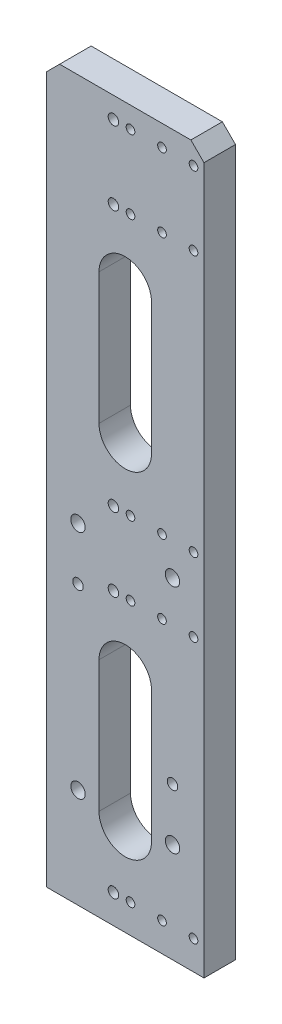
ISO-10303-21;
HEADER;
FILE_DESCRIPTION(('STEP AP214'),'2;1');
FILE_NAME('part.step','',(''),(''),'','','');
FILE_SCHEMA(('AUTOMOTIVE_DESIGN { 1 0 10303 214 1 1 1 1 }'));
ENDSEC;
DATA;
#1=APPLICATION_CONTEXT('core data for automotive mechanical design processes');
#2=APPLICATION_PROTOCOL_DEFINITION('international standard','automotive_design',2000,#1);
#3=PRODUCT_CONTEXT('',#1,'mechanical');
#4=PRODUCT('Part','Part','',(#3));
#5=PRODUCT_RELATED_PRODUCT_CATEGORY('part','',(#4));
#6=PRODUCT_DEFINITION_FORMATION('','',#4);
#7=PRODUCT_DEFINITION_CONTEXT('part definition',#1,'design');
#8=PRODUCT_DEFINITION('design','',#6,#7);
#9=PRODUCT_DEFINITION_SHAPE('','',#8);
#10=(LENGTH_UNIT() NAMED_UNIT(*) SI_UNIT(.MILLI.,.METRE.));
#11=(NAMED_UNIT(*) PLANE_ANGLE_UNIT() SI_UNIT($,.RADIAN.));
#12=(NAMED_UNIT(*) SI_UNIT($,.STERADIAN.) SOLID_ANGLE_UNIT());
#13=UNCERTAINTY_MEASURE_WITH_UNIT(LENGTH_MEASURE(1.E-05),#10,'distance_accuracy_value','');
#14=(GEOMETRIC_REPRESENTATION_CONTEXT(3) GLOBAL_UNCERTAINTY_ASSIGNED_CONTEXT((#13)) GLOBAL_UNIT_ASSIGNED_CONTEXT((#10,
#11,#12)) REPRESENTATION_CONTEXT('',''));
#15=CARTESIAN_POINT('',(0.,0.,0.));
#16=DIRECTION('',(0.,0.,1.));
#17=DIRECTION('',(1.,0.,0.));
#18=AXIS2_PLACEMENT_3D('',#15,#16,#17);
#19=CARTESIAN_POINT('',(14.1485562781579,232.812619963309,12.));
#20=DIRECTION('',(1.,0.,0.));
#21=DIRECTION('',(0.,0.,-1.));
#22=AXIS2_PLACEMENT_3D('',#19,#20,#21);
#23=PLANE('',#22);
#24=DIRECTION('',(0.,-1.,0.));
#25=VECTOR('',#24,1.);
#26=CARTESIAN_POINT('',(14.1485562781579,232.812619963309,12.));
#27=LINE('',#26,#25);
#28=CARTESIAN_POINT('',(14.1485562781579,501.812619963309,12.));
#29=VERTEX_POINT('',#28);
#30=CARTESIAN_POINT('',(14.1485562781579,232.812619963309,12.));
#31=VERTEX_POINT('',#30);
#32=EDGE_CURVE('E372',#29,#31,#27,.T.);
#33=ORIENTED_EDGE('',*,*,#32,.F.);
#34=DIRECTION('',(0.,0.,-1.));
#35=VECTOR('',#34,1.);
#36=CARTESIAN_POINT('',(14.1485562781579,501.812619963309,12.));
#37=LINE('',#36,#35);
#38=CARTESIAN_POINT('',(14.1485562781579,501.812619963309,0.));
#39=VERTEX_POINT('',#38);
#40=EDGE_CURVE('E11',#29,#39,#37,.T.);
#41=ORIENTED_EDGE('',*,*,#40,.T.);
#42=DIRECTION('',(0.,-1.,0.));
#43=VECTOR('',#42,1.);
#44=CARTESIAN_POINT('',(14.1485562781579,232.812619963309,0.));
#45=LINE('',#44,#43);
#46=CARTESIAN_POINT('',(14.1485562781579,232.812619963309,0.));
#47=VERTEX_POINT('',#46);
#48=EDGE_CURVE('E371',#39,#47,#45,.T.);
#49=ORIENTED_EDGE('',*,*,#48,.T.);
#50=DIRECTION('',(0.,0.,-1.));
#51=VECTOR('',#50,1.);
#52=CARTESIAN_POINT('',(14.1485562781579,232.812619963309,12.));
#53=LINE('',#52,#51);
#54=EDGE_CURVE('E388',#31,#47,#53,.T.);
#55=ORIENTED_EDGE('',*,*,#54,.F.);
#56=EDGE_LOOP('',(#33,#41,#49,#55));
#57=FACE_BOUND('',#56,.T.);
#58=ADVANCED_FACE('F16',(#57),#23,.F.);
#59=CARTESIAN_POINT('',(14.1485562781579,232.812619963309,12.));
#60=DIRECTION('',(0.,1.,0.));
#61=DIRECTION('',(0.,0.,1.));
#62=AXIS2_PLACEMENT_3D('',#59,#60,#61);
#63=PLANE('',#62);
#64=DIRECTION('',(1.,0.,0.));
#65=VECTOR('',#64,1.);
#66=CARTESIAN_POINT('',(14.1485562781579,232.812619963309,0.));
#67=LINE('',#66,#65);
#68=CARTESIAN_POINT('',(74.1485562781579,232.812619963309,0.));
#69=VERTEX_POINT('',#68);
#70=EDGE_CURVE('E382',#47,#69,#67,.T.);
#71=ORIENTED_EDGE('',*,*,#70,.T.);
#72=DIRECTION('',(0.,0.,-1.));
#73=VECTOR('',#72,1.);
#74=CARTESIAN_POINT('',(74.1485562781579,232.812619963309,12.));
#75=LINE('',#74,#73);
#76=CARTESIAN_POINT('',(74.1485562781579,232.812619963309,12.));
#77=VERTEX_POINT('',#76);
#78=EDGE_CURVE('E380',#77,#69,#75,.T.);
#79=ORIENTED_EDGE('',*,*,#78,.F.);
#80=DIRECTION('',(1.,0.,0.));
#81=VECTOR('',#80,1.);
#82=CARTESIAN_POINT('',(14.1485562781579,232.812619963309,12.));
#83=LINE('',#82,#81);
#84=EDGE_CURVE('E374',#31,#77,#83,.T.);
#85=ORIENTED_EDGE('',*,*,#84,.F.);
#86=ORIENTED_EDGE('',*,*,#54,.T.);
#87=EDGE_LOOP('',(#71,#79,#85,#86));
#88=FACE_BOUND('',#87,.T.);
#89=ADVANCED_FACE('F426',(#88),#63,.F.);
#90=CARTESIAN_POINT('',(74.1485562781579,232.812619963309,12.));
#91=DIRECTION('',(-1.,0.,0.));
#92=DIRECTION('',(0.,0.,1.));
#93=AXIS2_PLACEMENT_3D('',#90,#91,#92);
#94=PLANE('',#93);
#95=DIRECTION('',(0.,1.,0.));
#96=VECTOR('',#95,1.);
#97=CARTESIAN_POINT('',(74.1485562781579,232.812619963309,0.));
#98=LINE('',#97,#96);
#99=CARTESIAN_POINT('',(74.1485562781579,501.812619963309,0.));
#100=VERTEX_POINT('',#99);
#101=EDGE_CURVE('E375',#69,#100,#98,.T.);
#102=ORIENTED_EDGE('',*,*,#101,.T.);
#103=DIRECTION('',(0.,0.,1.));
#104=VECTOR('',#103,1.);
#105=CARTESIAN_POINT('',(74.1485562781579,501.812619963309,12.));
#106=LINE('',#105,#104);
#107=CARTESIAN_POINT('',(74.1485562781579,501.812619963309,12.));
#108=VERTEX_POINT('',#107);
#109=EDGE_CURVE('E400',#100,#108,#106,.T.);
#110=ORIENTED_EDGE('',*,*,#109,.T.);
#111=DIRECTION('',(0.,1.,0.));
#112=VECTOR('',#111,1.);
#113=CARTESIAN_POINT('',(74.1485562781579,232.812619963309,12.));
#114=LINE('',#113,#112);
#115=EDGE_CURVE('E377',#77,#108,#114,.T.);
#116=ORIENTED_EDGE('',*,*,#115,.F.);
#117=ORIENTED_EDGE('',*,*,#78,.T.);
#118=EDGE_LOOP('',(#102,#110,#116,#117));
#119=FACE_BOUND('',#118,.T.);
#120=ADVANCED_FACE('F422',(#119),#94,.F.);
#121=CARTESIAN_POINT('',(0.,0.,12.));
#122=DIRECTION('',(0.,0.,-1.));
#123=DIRECTION('',(-1.,0.,0.));
#124=AXIS2_PLACEMENT_3D('',#121,#122,#123);
#125=PLANE('',#124);
#126=DIRECTION('',(0.,1.,0.));
#127=VECTOR('',#126,1.);
#128=CARTESIAN_POINT('',(34.148556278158,317.812619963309,12.));
#129=LINE('',#128,#127);
#130=CARTESIAN_POINT('',(34.148556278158,267.812619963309,12.));
#131=VERTEX_POINT('',#130);
#132=CARTESIAN_POINT('',(34.148556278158,317.812619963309,12.));
#133=VERTEX_POINT('',#132);
#134=EDGE_CURVE('E125',#131,#133,#129,.T.);
#135=ORIENTED_EDGE('',*,*,#134,.T.);
#136=CARTESIAN_POINT('',(44.148556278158,317.812619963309,12.));
#137=DIRECTION('',(0.,0.,-1.));
#138=DIRECTION('',(-1.,0.,0.));
#139=AXIS2_PLACEMENT_3D('',#136,#137,#138);
#140=CIRCLE('',#139,10.);
#141=CARTESIAN_POINT('',(54.1485562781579,317.812619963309,12.));
#142=VERTEX_POINT('',#141);
#143=EDGE_CURVE('E119',#133,#142,#140,.T.);
#144=ORIENTED_EDGE('',*,*,#143,.T.);
#145=DIRECTION('',(0.,-1.,0.));
#146=VECTOR('',#145,1.);
#147=CARTESIAN_POINT('',(54.1485562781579,317.812619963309,12.));
#148=LINE('',#147,#146);
#149=CARTESIAN_POINT('',(54.1485562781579,267.812619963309,12.));
#150=VERTEX_POINT('',#149);
#151=EDGE_CURVE('E128',#142,#150,#148,.T.);
#152=ORIENTED_EDGE('',*,*,#151,.T.);
#153=CARTESIAN_POINT('',(44.1485562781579,267.812619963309,12.));
#154=DIRECTION('',(0.,0.,-1.));
#155=DIRECTION('',(-1.,0.,0.));
#156=AXIS2_PLACEMENT_3D('',#153,#154,#155);
#157=CIRCLE('',#156,10.);
#158=EDGE_CURVE('E31',#150,#131,#157,.T.);
#159=ORIENTED_EDGE('',*,*,#158,.T.);
#160=EDGE_LOOP('',(#135,#144,#152,#159));
#161=FACE_BOUND('',#160,.T.);
#162=DIRECTION('',(0.,1.,0.));
#163=VECTOR('',#162,1.);
#164=CARTESIAN_POINT('',(34.148556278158,445.812619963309,12.));
#165=LINE('',#164,#163);
#166=CARTESIAN_POINT('',(34.148556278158,395.812619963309,12.));
#167=VERTEX_POINT('',#166);
#168=CARTESIAN_POINT('',(34.148556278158,445.812619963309,12.));
#169=VERTEX_POINT('',#168);
#170=EDGE_CURVE('E164',#167,#169,#165,.T.);
#171=ORIENTED_EDGE('',*,*,#170,.T.);
#172=CARTESIAN_POINT('',(44.148556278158,445.812619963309,12.));
#173=DIRECTION('',(0.,0.,-1.));
#174=DIRECTION('',(-1.,0.,0.));
#175=AXIS2_PLACEMENT_3D('',#172,#173,#174);
#176=CIRCLE('',#175,10.);
#177=CARTESIAN_POINT('',(54.1485562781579,445.812619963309,12.));
#178=VERTEX_POINT('',#177);
#179=EDGE_CURVE('E154',#169,#178,#176,.T.);
#180=ORIENTED_EDGE('',*,*,#179,.T.);
#181=DIRECTION('',(0.,-1.,0.));
#182=VECTOR('',#181,1.);
#183=CARTESIAN_POINT('',(54.1485562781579,445.812619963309,12.));
#184=LINE('',#183,#182);
#185=CARTESIAN_POINT('',(54.1485562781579,395.812619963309,12.));
#186=VERTEX_POINT('',#185);
#187=EDGE_CURVE('E157',#178,#186,#184,.T.);
#188=ORIENTED_EDGE('',*,*,#187,.T.);
#189=CARTESIAN_POINT('',(44.148556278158,395.812619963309,12.));
#190=DIRECTION('',(0.,0.,-1.));
#191=DIRECTION('',(-1.,0.,0.));
#192=AXIS2_PLACEMENT_3D('',#189,#190,#191);
#193=CIRCLE('',#192,10.);
#194=EDGE_CURVE('E161',#186,#167,#193,.T.);
#195=ORIENTED_EDGE('',*,*,#194,.T.);
#196=EDGE_LOOP('',(#171,#180,#188,#195));
#197=FACE_BOUND('',#196,.T.);
#198=CARTESIAN_POINT('',(62.1485562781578,290.812619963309,12.));
#199=DIRECTION('',(0.,0.,-1.));
#200=DIRECTION('',(-1.,0.,0.));
#201=AXIS2_PLACEMENT_3D('',#198,#199,#200);
#202=CIRCLE('',#201,2.);
#203=CARTESIAN_POINT('',(60.1485562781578,290.812619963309,12.));
#204=VERTEX_POINT('',#203);
#205=EDGE_CURVE('E194',#204,#204,#202,.T.);
#206=ORIENTED_EDGE('',*,*,#205,.T.);
#207=EDGE_LOOP('',(#206));
#208=FACE_BOUND('',#207,.T.);
#209=CARTESIAN_POINT('',(26.1485562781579,338.812619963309,12.));
#210=DIRECTION('',(0.,0.,-1.));
#211=DIRECTION('',(-1.,0.,0.));
#212=AXIS2_PLACEMENT_3D('',#209,#210,#211);
#213=CIRCLE('',#212,2.);
#214=CARTESIAN_POINT('',(24.1485562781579,338.812619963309,12.));
#215=VERTEX_POINT('',#214);
#216=EDGE_CURVE('E200',#215,#215,#213,.T.);
#217=ORIENTED_EDGE('',*,*,#216,.T.);
#218=EDGE_LOOP('',(#217));
#219=FACE_BOUND('',#218,.T.);
#220=CARTESIAN_POINT('',(62.1485562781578,270.812619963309,12.));
#221=DIRECTION('',(0.,0.,-1.));
#222=DIRECTION('',(-1.,0.,0.));
#223=AXIS2_PLACEMENT_3D('',#220,#221,#222);
#224=CIRCLE('',#223,2.75);
#225=CARTESIAN_POINT('',(59.3985562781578,270.812619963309,12.));
#226=VERTEX_POINT('',#225);
#227=EDGE_CURVE('E212',#226,#226,#224,.T.);
#228=ORIENTED_EDGE('',*,*,#227,.T.);
#229=EDGE_LOOP('',(#228));
#230=FACE_BOUND('',#229,.T.);
#231=CARTESIAN_POINT('',(26.1485562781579,270.812619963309,12.));
#232=DIRECTION('',(0.,0.,-1.));
#233=DIRECTION('',(-1.,0.,0.));
#234=AXIS2_PLACEMENT_3D('',#231,#232,#233);
#235=CIRCLE('',#234,2.75);
#236=CARTESIAN_POINT('',(23.3985562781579,270.812619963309,12.));
#237=VERTEX_POINT('',#236);
#238=EDGE_CURVE('E224',#237,#237,#235,.T.);
#239=ORIENTED_EDGE('',*,*,#238,.T.);
#240=EDGE_LOOP('',(#239));
#241=FACE_BOUND('',#240,.T.);
#242=CARTESIAN_POINT('',(26.1485562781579,358.812619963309,12.));
#243=DIRECTION('',(0.,0.,-1.));
#244=DIRECTION('',(-1.,0.,0.));
#245=AXIS2_PLACEMENT_3D('',#242,#243,#244);
#246=CIRCLE('',#245,2.75);
#247=CARTESIAN_POINT('',(23.3985562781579,358.812619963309,12.));
#248=VERTEX_POINT('',#247);
#249=EDGE_CURVE('E236',#248,#248,#246,.T.);
#250=ORIENTED_EDGE('',*,*,#249,.T.);
#251=EDGE_LOOP('',(#250));
#252=FACE_BOUND('',#251,.T.);
#253=CARTESIAN_POINT('',(62.1485562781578,358.812619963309,12.));
#254=DIRECTION('',(0.,0.,-1.));
#255=DIRECTION('',(-1.,0.,0.));
#256=AXIS2_PLACEMENT_3D('',#253,#254,#255);
#257=CIRCLE('',#256,2.75);
#258=CARTESIAN_POINT('',(59.3985562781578,358.812619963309,12.));
#259=VERTEX_POINT('',#258);
#260=EDGE_CURVE('E248',#259,#259,#257,.T.);
#261=ORIENTED_EDGE('',*,*,#260,.T.);
#262=EDGE_LOOP('',(#261));
#263=FACE_BOUND('',#262,.T.);
#264=CARTESIAN_POINT('',(70.1485562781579,498.812619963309,12.));
#265=DIRECTION('',(0.,0.,-1.));
#266=DIRECTION('',(-1.,0.,0.));
#267=AXIS2_PLACEMENT_3D('',#264,#265,#266);
#268=CIRCLE('',#267,1.65);
#269=CARTESIAN_POINT('',(68.4985562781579,498.812619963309,12.));
#270=VERTEX_POINT('',#269);
#271=EDGE_CURVE('E254',#270,#270,#268,.T.);
#272=ORIENTED_EDGE('',*,*,#271,.T.);
#273=EDGE_LOOP('',(#272));
#274=FACE_BOUND('',#273,.T.);
#275=CARTESIAN_POINT('',(70.1485562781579,470.812619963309,12.));
#276=DIRECTION('',(0.,0.,-1.));
#277=DIRECTION('',(-1.,0.,0.));
#278=AXIS2_PLACEMENT_3D('',#275,#276,#277);
#279=CIRCLE('',#278,1.65);
#280=CARTESIAN_POINT('',(68.4985562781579,470.812619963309,12.));
#281=VERTEX_POINT('',#280);
#282=EDGE_CURVE('E260',#281,#281,#279,.T.);
#283=ORIENTED_EDGE('',*,*,#282,.T.);
#284=EDGE_LOOP('',(#283));
#285=FACE_BOUND('',#284,.T.);
#286=CARTESIAN_POINT('',(58.1485562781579,470.812619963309,12.));
#287=DIRECTION('',(0.,0.,-1.));
#288=DIRECTION('',(-1.,0.,0.));
#289=AXIS2_PLACEMENT_3D('',#286,#287,#288);
#290=CIRCLE('',#289,1.65);
#291=CARTESIAN_POINT('',(56.4985562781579,470.812619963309,12.));
#292=VERTEX_POINT('',#291);
#293=EDGE_CURVE('E266',#292,#292,#290,.T.);
#294=ORIENTED_EDGE('',*,*,#293,.T.);
#295=EDGE_LOOP('',(#294));
#296=FACE_BOUND('',#295,.T.);
#297=CARTESIAN_POINT('',(58.1485562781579,498.812619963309,12.));
#298=DIRECTION('',(0.,0.,-1.));
#299=DIRECTION('',(-1.,0.,0.));
#300=AXIS2_PLACEMENT_3D('',#297,#298,#299);
#301=CIRCLE('',#300,1.65);
#302=CARTESIAN_POINT('',(56.4985562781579,498.812619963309,12.));
#303=VERTEX_POINT('',#302);
#304=EDGE_CURVE('E272',#303,#303,#301,.T.);
#305=ORIENTED_EDGE('',*,*,#304,.T.);
#306=EDGE_LOOP('',(#305));
#307=FACE_BOUND('',#306,.T.);
#308=CARTESIAN_POINT('',(70.1485562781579,371.312619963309,12.));
#309=DIRECTION('',(0.,0.,-1.));
#310=DIRECTION('',(-1.,0.,0.));
#311=AXIS2_PLACEMENT_3D('',#308,#309,#310);
#312=CIRCLE('',#311,1.65);
#313=CARTESIAN_POINT('',(68.4985562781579,371.312619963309,12.));
#314=VERTEX_POINT('',#313);
#315=EDGE_CURVE('E278',#314,#314,#312,.T.);
#316=ORIENTED_EDGE('',*,*,#315,.T.);
#317=EDGE_LOOP('',(#316));
#318=FACE_BOUND('',#317,.T.);
#319=CARTESIAN_POINT('',(58.1485562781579,371.312619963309,12.));
#320=DIRECTION('',(0.,0.,-1.));
#321=DIRECTION('',(-1.,0.,0.));
#322=AXIS2_PLACEMENT_3D('',#319,#320,#321);
#323=CIRCLE('',#322,1.65);
#324=CARTESIAN_POINT('',(56.4985562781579,371.312619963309,12.));
#325=VERTEX_POINT('',#324);
#326=EDGE_CURVE('E284',#325,#325,#323,.T.);
#327=ORIENTED_EDGE('',*,*,#326,.T.);
#328=EDGE_LOOP('',(#327));
#329=FACE_BOUND('',#328,.T.);
#330=CARTESIAN_POINT('',(58.1485562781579,343.312619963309,12.));
#331=DIRECTION('',(0.,0.,-1.));
#332=DIRECTION('',(-1.,0.,0.));
#333=AXIS2_PLACEMENT_3D('',#330,#331,#332);
#334=CIRCLE('',#333,1.65);
#335=CARTESIAN_POINT('',(56.4985562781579,343.312619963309,12.));
#336=VERTEX_POINT('',#335);
#337=EDGE_CURVE('E290',#336,#336,#334,.T.);
#338=ORIENTED_EDGE('',*,*,#337,.T.);
#339=EDGE_LOOP('',(#338));
#340=FACE_BOUND('',#339,.T.);
#341=CARTESIAN_POINT('',(70.1485562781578,343.312619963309,12.));
#342=DIRECTION('',(0.,0.,-1.));
#343=DIRECTION('',(-1.,0.,0.));
#344=AXIS2_PLACEMENT_3D('',#341,#342,#343);
#345=CIRCLE('',#344,1.65);
#346=CARTESIAN_POINT('',(68.4985562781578,343.312619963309,12.));
#347=VERTEX_POINT('',#346);
#348=EDGE_CURVE('E296',#347,#347,#345,.T.);
#349=ORIENTED_EDGE('',*,*,#348,.T.);
#350=EDGE_LOOP('',(#349));
#351=FACE_BOUND('',#350,.T.);
#352=CARTESIAN_POINT('',(58.1485562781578,243.812619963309,12.));
#353=DIRECTION('',(0.,0.,-1.));
#354=DIRECTION('',(-1.,0.,0.));
#355=AXIS2_PLACEMENT_3D('',#352,#353,#354);
#356=CIRCLE('',#355,1.65);
#357=CARTESIAN_POINT('',(56.4985562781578,243.812619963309,12.));
#358=VERTEX_POINT('',#357);
#359=EDGE_CURVE('E302',#358,#358,#356,.T.);
#360=ORIENTED_EDGE('',*,*,#359,.T.);
#361=EDGE_LOOP('',(#360));
#362=FACE_BOUND('',#361,.T.);
#363=CARTESIAN_POINT('',(70.1485562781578,243.812619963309,12.));
#364=DIRECTION('',(0.,0.,-1.));
#365=DIRECTION('',(-1.,0.,0.));
#366=AXIS2_PLACEMENT_3D('',#363,#364,#365);
#367=CIRCLE('',#366,1.65);
#368=CARTESIAN_POINT('',(68.4985562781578,243.812619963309,12.));
#369=VERTEX_POINT('',#368);
#370=EDGE_CURVE('E308',#369,#369,#367,.T.);
#371=ORIENTED_EDGE('',*,*,#370,.T.);
#372=EDGE_LOOP('',(#371));
#373=FACE_BOUND('',#372,.T.);
#374=CARTESIAN_POINT('',(46.1485562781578,243.812619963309,12.));
#375=DIRECTION('',(0.,0.,-1.));
#376=DIRECTION('',(-1.,0.,0.));
#377=AXIS2_PLACEMENT_3D('',#374,#375,#376);
#378=CIRCLE('',#377,1.65);
#379=CARTESIAN_POINT('',(44.4985562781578,243.812619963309,12.));
#380=VERTEX_POINT('',#379);
#381=EDGE_CURVE('E314',#380,#380,#378,.T.);
#382=ORIENTED_EDGE('',*,*,#381,.T.);
#383=EDGE_LOOP('',(#382));
#384=FACE_BOUND('',#383,.T.);
#385=CARTESIAN_POINT('',(46.1485562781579,343.312619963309,12.));
#386=DIRECTION('',(0.,0.,-1.));
#387=DIRECTION('',(-1.,0.,0.));
#388=AXIS2_PLACEMENT_3D('',#385,#386,#387);
#389=CIRCLE('',#388,1.65);
#390=CARTESIAN_POINT('',(44.4985562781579,343.312619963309,12.));
#391=VERTEX_POINT('',#390);
#392=EDGE_CURVE('E320',#391,#391,#389,.T.);
#393=ORIENTED_EDGE('',*,*,#392,.T.);
#394=EDGE_LOOP('',(#393));
#395=FACE_BOUND('',#394,.T.);
#396=CARTESIAN_POINT('',(46.1485562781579,371.312619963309,12.));
#397=DIRECTION('',(0.,0.,-1.));
#398=DIRECTION('',(-1.,0.,0.));
#399=AXIS2_PLACEMENT_3D('',#396,#397,#398);
#400=CIRCLE('',#399,1.65);
#401=CARTESIAN_POINT('',(44.4985562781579,371.312619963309,12.));
#402=VERTEX_POINT('',#401);
#403=EDGE_CURVE('E326',#402,#402,#400,.T.);
#404=ORIENTED_EDGE('',*,*,#403,.T.);
#405=EDGE_LOOP('',(#404));
#406=FACE_BOUND('',#405,.T.);
#407=CARTESIAN_POINT('',(46.1485562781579,470.812619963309,12.));
#408=DIRECTION('',(0.,0.,-1.));
#409=DIRECTION('',(-1.,0.,0.));
#410=AXIS2_PLACEMENT_3D('',#407,#408,#409);
#411=CIRCLE('',#410,1.65);
#412=CARTESIAN_POINT('',(44.4985562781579,470.812619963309,12.));
#413=VERTEX_POINT('',#412);
#414=EDGE_CURVE('E332',#413,#413,#411,.T.);
#415=ORIENTED_EDGE('',*,*,#414,.T.);
#416=EDGE_LOOP('',(#415));
#417=FACE_BOUND('',#416,.T.);
#418=CARTESIAN_POINT('',(46.1485562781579,498.812619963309,12.));
#419=DIRECTION('',(0.,0.,-1.));
#420=DIRECTION('',(-1.,0.,0.));
#421=AXIS2_PLACEMENT_3D('',#418,#419,#420);
#422=CIRCLE('',#421,1.65);
#423=CARTESIAN_POINT('',(44.4985562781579,498.812619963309,12.));
#424=VERTEX_POINT('',#423);
#425=EDGE_CURVE('E338',#424,#424,#422,.T.);
#426=ORIENTED_EDGE('',*,*,#425,.T.);
#427=EDGE_LOOP('',(#426));
#428=FACE_BOUND('',#427,.T.);
#429=CARTESIAN_POINT('',(39.6485562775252,243.812619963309,12.));
#430=DIRECTION('',(0.,0.,-1.));
#431=DIRECTION('',(-1.,0.,0.));
#432=AXIS2_PLACEMENT_3D('',#429,#430,#431);
#433=CIRCLE('',#432,2.);
#434=CARTESIAN_POINT('',(37.6485562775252,243.812619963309,12.));
#435=VERTEX_POINT('',#434);
#436=EDGE_CURVE('E344',#435,#435,#433,.T.);
#437=ORIENTED_EDGE('',*,*,#436,.T.);
#438=EDGE_LOOP('',(#437));
#439=FACE_BOUND('',#438,.T.);
#440=CARTESIAN_POINT('',(39.6485562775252,343.312619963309,12.));
#441=DIRECTION('',(0.,0.,-1.));
#442=DIRECTION('',(-1.,0.,0.));
#443=AXIS2_PLACEMENT_3D('',#440,#441,#442);
#444=CIRCLE('',#443,2.);
#445=CARTESIAN_POINT('',(37.6485562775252,343.312619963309,12.));
#446=VERTEX_POINT('',#445);
#447=EDGE_CURVE('E350',#446,#446,#444,.T.);
#448=ORIENTED_EDGE('',*,*,#447,.T.);
#449=EDGE_LOOP('',(#448));
#450=FACE_BOUND('',#449,.T.);
#451=CARTESIAN_POINT('',(39.6485562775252,371.312619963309,12.));
#452=DIRECTION('',(0.,0.,-1.));
#453=DIRECTION('',(-1.,0.,0.));
#454=AXIS2_PLACEMENT_3D('',#451,#452,#453);
#455=CIRCLE('',#454,2.);
#456=CARTESIAN_POINT('',(37.6485562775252,371.312619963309,12.));
#457=VERTEX_POINT('',#456);
#458=EDGE_CURVE('E356',#457,#457,#455,.T.);
#459=ORIENTED_EDGE('',*,*,#458,.T.);
#460=EDGE_LOOP('',(#459));
#461=FACE_BOUND('',#460,.T.);
#462=CARTESIAN_POINT('',(39.6485562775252,470.812619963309,12.));
#463=DIRECTION('',(0.,0.,-1.));
#464=DIRECTION('',(-1.,0.,0.));
#465=AXIS2_PLACEMENT_3D('',#462,#463,#464);
#466=CIRCLE('',#465,2.);
#467=CARTESIAN_POINT('',(37.6485562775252,470.812619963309,12.));
#468=VERTEX_POINT('',#467);
#469=EDGE_CURVE('E362',#468,#468,#466,.T.);
#470=ORIENTED_EDGE('',*,*,#469,.T.);
#471=EDGE_LOOP('',(#470));
#472=FACE_BOUND('',#471,.T.);
#473=CARTESIAN_POINT('',(39.6485562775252,498.812619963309,12.));
#474=DIRECTION('',(0.,0.,-1.));
#475=DIRECTION('',(-1.,0.,0.));
#476=AXIS2_PLACEMENT_3D('',#473,#474,#475);
#477=CIRCLE('',#476,2.);
#478=CARTESIAN_POINT('',(37.6485562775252,498.812619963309,12.));
#479=VERTEX_POINT('',#478);
#480=EDGE_CURVE('E368',#479,#479,#477,.T.);
#481=ORIENTED_EDGE('',*,*,#480,.T.);
#482=EDGE_LOOP('',(#481));
#483=FACE_BOUND('',#482,.T.);
#484=ORIENTED_EDGE('',*,*,#115,.T.);
#485=DIRECTION('',(0.707106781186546,-0.70710678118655,0.));
#486=VECTOR('',#485,1.);
#487=CARTESIAN_POINT('',(69.1485562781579,506.812619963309,12.));
#488=LINE('',#487,#486);
#489=CARTESIAN_POINT('',(69.1485562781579,506.812619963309,12.));
#490=VERTEX_POINT('',#489);
#491=EDGE_CURVE('E24',#108,#490,#488,.F.);
#492=ORIENTED_EDGE('',*,*,#491,.T.);
#493=DIRECTION('',(-1.,0.,0.));
#494=VECTOR('',#493,1.);
#495=CARTESIAN_POINT('',(74.1485562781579,506.812619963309,12.));
#496=LINE('',#495,#494);
#497=CARTESIAN_POINT('',(19.1485562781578,506.812619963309,12.));
#498=VERTEX_POINT('',#497);
#499=EDGE_CURVE('E186',#490,#498,#496,.T.);
#500=ORIENTED_EDGE('',*,*,#499,.T.);
#501=DIRECTION('',(0.707106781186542,0.707106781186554,0.));
#502=VECTOR('',#501,1.);
#503=CARTESIAN_POINT('',(14.1485562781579,501.812619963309,12.));
#504=LINE('',#503,#502);
#505=EDGE_CURVE('E402',#498,#29,#504,.F.);
#506=ORIENTED_EDGE('',*,*,#505,.T.);
#507=ORIENTED_EDGE('',*,*,#32,.T.);
#508=ORIENTED_EDGE('',*,*,#84,.T.);
#509=EDGE_LOOP('',(#484,#492,#500,#506,#507,#508));
#510=FACE_BOUND('',#509,.T.);
#511=ADVANCED_FACE('F132',(#161,#197,#208,#219,#230,#241,#252,#263,#274,#285,#296,#307,#318,
#329,#340,#351,#362,#373,#384,#395,#406,#417,#428,#439,#450,#461,#472,#483,#510),#125,.F.);
#512=CARTESIAN_POINT('',(0.,0.,0.));
#513=DIRECTION('',(0.,0.,-1.));
#514=DIRECTION('',(-1.,0.,0.));
#515=AXIS2_PLACEMENT_3D('',#512,#513,#514);
#516=PLANE('',#515);
#517=CARTESIAN_POINT('',(44.148556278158,317.812619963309,0.));
#518=DIRECTION('',(0.,0.,-1.));
#519=DIRECTION('',(-1.,0.,0.));
#520=AXIS2_PLACEMENT_3D('',#517,#518,#519);
#521=CIRCLE('',#520,10.);
#522=CARTESIAN_POINT('',(34.148556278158,317.812619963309,0.));
#523=VERTEX_POINT('',#522);
#524=CARTESIAN_POINT('',(54.1485562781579,317.812619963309,0.));
#525=VERTEX_POINT('',#524);
#526=EDGE_CURVE('E39',#523,#525,#521,.T.);
#527=ORIENTED_EDGE('',*,*,#526,.F.);
#528=DIRECTION('',(0.,1.,0.));
#529=VECTOR('',#528,1.);
#530=CARTESIAN_POINT('',(34.148556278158,317.812619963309,0.));
#531=LINE('',#530,#529);
#532=CARTESIAN_POINT('',(34.148556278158,267.812619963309,0.));
#533=VERTEX_POINT('',#532);
#534=EDGE_CURVE('E135',#533,#523,#531,.T.);
#535=ORIENTED_EDGE('',*,*,#534,.F.);
#536=CARTESIAN_POINT('',(44.1485562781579,267.812619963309,0.));
#537=DIRECTION('',(0.,0.,-1.));
#538=DIRECTION('',(-1.,0.,0.));
#539=AXIS2_PLACEMENT_3D('',#536,#537,#538);
#540=CIRCLE('',#539,10.);
#541=CARTESIAN_POINT('',(54.1485562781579,267.812619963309,0.));
#542=VERTEX_POINT('',#541);
#543=EDGE_CURVE('E138',#542,#533,#540,.T.);
#544=ORIENTED_EDGE('',*,*,#543,.F.);
#545=DIRECTION('',(0.,-1.,0.));
#546=VECTOR('',#545,1.);
#547=CARTESIAN_POINT('',(54.1485562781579,317.812619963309,0.));
#548=LINE('',#547,#546);
#549=EDGE_CURVE('E144',#525,#542,#548,.T.);
#550=ORIENTED_EDGE('',*,*,#549,.F.);
#551=EDGE_LOOP('',(#527,#535,#544,#550));
#552=FACE_BOUND('',#551,.T.);
#553=CARTESIAN_POINT('',(44.148556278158,445.812619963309,0.));
#554=DIRECTION('',(0.,0.,-1.));
#555=DIRECTION('',(-1.,0.,0.));
#556=AXIS2_PLACEMENT_3D('',#553,#554,#555);
#557=CIRCLE('',#556,10.);
#558=CARTESIAN_POINT('',(34.148556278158,445.812619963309,0.));
#559=VERTEX_POINT('',#558);
#560=CARTESIAN_POINT('',(54.1485562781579,445.812619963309,0.));
#561=VERTEX_POINT('',#560);
#562=EDGE_CURVE('E150',#559,#561,#557,.T.);
#563=ORIENTED_EDGE('',*,*,#562,.F.);
#564=DIRECTION('',(0.,1.,0.));
#565=VECTOR('',#564,1.);
#566=CARTESIAN_POINT('',(34.148556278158,445.812619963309,0.));
#567=LINE('',#566,#565);
#568=CARTESIAN_POINT('',(34.148556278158,395.812619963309,0.));
#569=VERTEX_POINT('',#568);
#570=EDGE_CURVE('E158',#569,#559,#567,.T.);
#571=ORIENTED_EDGE('',*,*,#570,.F.);
#572=CARTESIAN_POINT('',(44.148556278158,395.812619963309,0.));
#573=DIRECTION('',(0.,0.,-1.));
#574=DIRECTION('',(-1.,0.,0.));
#575=AXIS2_PLACEMENT_3D('',#572,#573,#574);
#576=CIRCLE('',#575,10.);
#577=CARTESIAN_POINT('',(54.1485562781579,395.812619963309,0.));
#578=VERTEX_POINT('',#577);
#579=EDGE_CURVE('E172',#578,#569,#576,.T.);
#580=ORIENTED_EDGE('',*,*,#579,.F.);
#581=DIRECTION('',(0.,-1.,0.));
#582=VECTOR('',#581,1.);
#583=CARTESIAN_POINT('',(54.1485562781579,445.812619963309,0.));
#584=LINE('',#583,#582);
#585=EDGE_CURVE('E169',#561,#578,#584,.T.);
#586=ORIENTED_EDGE('',*,*,#585,.F.);
#587=EDGE_LOOP('',(#563,#571,#580,#586));
#588=FACE_BOUND('',#587,.T.);
#589=DIRECTION('',(-1.,0.,0.));
#590=VECTOR('',#589,1.);
#591=CARTESIAN_POINT('',(74.1485562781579,506.812619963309,0.));
#592=LINE('',#591,#590);
#593=CARTESIAN_POINT('',(69.148556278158,506.812619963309,0.));
#594=VERTEX_POINT('',#593);
#595=CARTESIAN_POINT('',(19.1485562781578,506.812619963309,0.));
#596=VERTEX_POINT('',#595);
#597=EDGE_CURVE('E179',#594,#596,#592,.T.);
#598=ORIENTED_EDGE('',*,*,#597,.F.);
#599=DIRECTION('',(-0.707106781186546,0.70710678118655,0.));
#600=VECTOR('',#599,1.);
#601=CARTESIAN_POINT('',(287.980588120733,287.980588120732,0.));
#602=LINE('',#601,#600);
#603=EDGE_CURVE('E398',#594,#100,#602,.F.);
#604=ORIENTED_EDGE('',*,*,#603,.T.);
#605=ORIENTED_EDGE('',*,*,#101,.F.);
#606=ORIENTED_EDGE('',*,*,#70,.F.);
#607=ORIENTED_EDGE('',*,*,#48,.F.);
#608=DIRECTION('',(-0.707106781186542,-0.707106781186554,0.));
#609=VECTOR('',#608,1.);
#610=CARTESIAN_POINT('',(-243.832031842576,243.832031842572,0.));
#611=LINE('',#610,#609);
#612=EDGE_CURVE('E396',#39,#596,#611,.F.);
#613=ORIENTED_EDGE('',*,*,#612,.T.);
#614=EDGE_LOOP('',(#598,#604,#605,#606,#607,#613));
#615=FACE_BOUND('',#614,.T.);
#616=CARTESIAN_POINT('',(62.1485562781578,290.812619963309,0.));
#617=DIRECTION('',(0.,0.,-1.));
#618=DIRECTION('',(-1.,0.,0.));
#619=AXIS2_PLACEMENT_3D('',#616,#617,#618);
#620=CIRCLE('',#619,2.);
#621=CARTESIAN_POINT('',(60.1485562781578,290.812619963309,0.));
#622=VERTEX_POINT('',#621);
#623=EDGE_CURVE('E189',#622,#622,#620,.T.);
#624=ORIENTED_EDGE('',*,*,#623,.F.);
#625=EDGE_LOOP('',(#624));
#626=FACE_BOUND('',#625,.T.);
#627=CARTESIAN_POINT('',(26.1485562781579,338.812619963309,0.));
#628=DIRECTION('',(0.,0.,-1.));
#629=DIRECTION('',(-1.,0.,0.));
#630=AXIS2_PLACEMENT_3D('',#627,#628,#629);
#631=CIRCLE('',#630,2.);
#632=CARTESIAN_POINT('',(24.1485562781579,338.812619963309,0.));
#633=VERTEX_POINT('',#632);
#634=EDGE_CURVE('E197',#633,#633,#631,.T.);
#635=ORIENTED_EDGE('',*,*,#634,.F.);
#636=EDGE_LOOP('',(#635));
#637=FACE_BOUND('',#636,.T.);
#638=CARTESIAN_POINT('',(62.1485562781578,270.812619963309,0.));
#639=DIRECTION('',(0.,0.,-1.));
#640=DIRECTION('',(-1.,0.,0.));
#641=AXIS2_PLACEMENT_3D('',#638,#639,#640);
#642=CIRCLE('',#641,5.);
#643=CARTESIAN_POINT('',(57.1485562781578,270.812619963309,0.));
#644=VERTEX_POINT('',#643);
#645=EDGE_CURVE('E203',#644,#644,#642,.T.);
#646=ORIENTED_EDGE('',*,*,#645,.F.);
#647=EDGE_LOOP('',(#646));
#648=FACE_BOUND('',#647,.T.);
#649=CARTESIAN_POINT('',(26.1485562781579,270.812619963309,0.));
#650=DIRECTION('',(0.,0.,-1.));
#651=DIRECTION('',(-1.,0.,0.));
#652=AXIS2_PLACEMENT_3D('',#649,#650,#651);
#653=CIRCLE('',#652,5.);
#654=CARTESIAN_POINT('',(21.1485562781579,270.812619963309,0.));
#655=VERTEX_POINT('',#654);
#656=EDGE_CURVE('E215',#655,#655,#653,.T.);
#657=ORIENTED_EDGE('',*,*,#656,.F.);
#658=EDGE_LOOP('',(#657));
#659=FACE_BOUND('',#658,.T.);
#660=CARTESIAN_POINT('',(26.1485562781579,358.812619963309,0.));
#661=DIRECTION('',(0.,0.,-1.));
#662=DIRECTION('',(-1.,0.,0.));
#663=AXIS2_PLACEMENT_3D('',#660,#661,#662);
#664=CIRCLE('',#663,5.);
#665=CARTESIAN_POINT('',(21.1485562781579,358.812619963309,0.));
#666=VERTEX_POINT('',#665);
#667=EDGE_CURVE('E227',#666,#666,#664,.T.);
#668=ORIENTED_EDGE('',*,*,#667,.F.);
#669=EDGE_LOOP('',(#668));
#670=FACE_BOUND('',#669,.T.);
#671=CARTESIAN_POINT('',(62.1485562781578,358.812619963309,0.));
#672=DIRECTION('',(0.,0.,-1.));
#673=DIRECTION('',(-1.,0.,0.));
#674=AXIS2_PLACEMENT_3D('',#671,#672,#673);
#675=CIRCLE('',#674,5.);
#676=CARTESIAN_POINT('',(57.1485562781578,358.812619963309,0.));
#677=VERTEX_POINT('',#676);
#678=EDGE_CURVE('E239',#677,#677,#675,.T.);
#679=ORIENTED_EDGE('',*,*,#678,.F.);
#680=EDGE_LOOP('',(#679));
#681=FACE_BOUND('',#680,.T.);
#682=CARTESIAN_POINT('',(70.1485562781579,498.812619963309,0.));
#683=DIRECTION('',(0.,0.,-1.));
#684=DIRECTION('',(-1.,0.,0.));
#685=AXIS2_PLACEMENT_3D('',#682,#683,#684);
#686=CIRCLE('',#685,1.65);
#687=CARTESIAN_POINT('',(68.4985562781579,498.812619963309,0.));
#688=VERTEX_POINT('',#687);
#689=EDGE_CURVE('E251',#688,#688,#686,.T.);
#690=ORIENTED_EDGE('',*,*,#689,.F.);
#691=EDGE_LOOP('',(#690));
#692=FACE_BOUND('',#691,.T.);
#693=CARTESIAN_POINT('',(70.1485562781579,470.812619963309,0.));
#694=DIRECTION('',(0.,0.,-1.));
#695=DIRECTION('',(-1.,0.,0.));
#696=AXIS2_PLACEMENT_3D('',#693,#694,#695);
#697=CIRCLE('',#696,1.65);
#698=CARTESIAN_POINT('',(68.4985562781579,470.812619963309,0.));
#699=VERTEX_POINT('',#698);
#700=EDGE_CURVE('E257',#699,#699,#697,.T.);
#701=ORIENTED_EDGE('',*,*,#700,.F.);
#702=EDGE_LOOP('',(#701));
#703=FACE_BOUND('',#702,.T.);
#704=CARTESIAN_POINT('',(58.1485562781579,470.812619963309,0.));
#705=DIRECTION('',(0.,0.,-1.));
#706=DIRECTION('',(-1.,0.,0.));
#707=AXIS2_PLACEMENT_3D('',#704,#705,#706);
#708=CIRCLE('',#707,1.65);
#709=CARTESIAN_POINT('',(56.4985562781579,470.812619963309,0.));
#710=VERTEX_POINT('',#709);
#711=EDGE_CURVE('E263',#710,#710,#708,.T.);
#712=ORIENTED_EDGE('',*,*,#711,.F.);
#713=EDGE_LOOP('',(#712));
#714=FACE_BOUND('',#713,.T.);
#715=CARTESIAN_POINT('',(58.1485562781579,498.812619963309,0.));
#716=DIRECTION('',(0.,0.,-1.));
#717=DIRECTION('',(-1.,0.,0.));
#718=AXIS2_PLACEMENT_3D('',#715,#716,#717);
#719=CIRCLE('',#718,1.65);
#720=CARTESIAN_POINT('',(56.4985562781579,498.812619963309,0.));
#721=VERTEX_POINT('',#720);
#722=EDGE_CURVE('E269',#721,#721,#719,.T.);
#723=ORIENTED_EDGE('',*,*,#722,.F.);
#724=EDGE_LOOP('',(#723));
#725=FACE_BOUND('',#724,.T.);
#726=CARTESIAN_POINT('',(70.1485562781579,371.312619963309,0.));
#727=DIRECTION('',(0.,0.,-1.));
#728=DIRECTION('',(-1.,0.,0.));
#729=AXIS2_PLACEMENT_3D('',#726,#727,#728);
#730=CIRCLE('',#729,1.65);
#731=CARTESIAN_POINT('',(68.4985562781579,371.312619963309,0.));
#732=VERTEX_POINT('',#731);
#733=EDGE_CURVE('E275',#732,#732,#730,.T.);
#734=ORIENTED_EDGE('',*,*,#733,.F.);
#735=EDGE_LOOP('',(#734));
#736=FACE_BOUND('',#735,.T.);
#737=CARTESIAN_POINT('',(58.1485562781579,371.312619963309,0.));
#738=DIRECTION('',(0.,0.,-1.));
#739=DIRECTION('',(-1.,0.,0.));
#740=AXIS2_PLACEMENT_3D('',#737,#738,#739);
#741=CIRCLE('',#740,1.65);
#742=CARTESIAN_POINT('',(56.4985562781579,371.312619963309,0.));
#743=VERTEX_POINT('',#742);
#744=EDGE_CURVE('E281',#743,#743,#741,.T.);
#745=ORIENTED_EDGE('',*,*,#744,.F.);
#746=EDGE_LOOP('',(#745));
#747=FACE_BOUND('',#746,.T.);
#748=CARTESIAN_POINT('',(58.1485562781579,343.312619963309,0.));
#749=DIRECTION('',(0.,0.,-1.));
#750=DIRECTION('',(-1.,0.,0.));
#751=AXIS2_PLACEMENT_3D('',#748,#749,#750);
#752=CIRCLE('',#751,1.65);
#753=CARTESIAN_POINT('',(56.4985562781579,343.312619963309,0.));
#754=VERTEX_POINT('',#753);
#755=EDGE_CURVE('E287',#754,#754,#752,.T.);
#756=ORIENTED_EDGE('',*,*,#755,.F.);
#757=EDGE_LOOP('',(#756));
#758=FACE_BOUND('',#757,.T.);
#759=CARTESIAN_POINT('',(70.1485562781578,343.312619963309,0.));
#760=DIRECTION('',(0.,0.,-1.));
#761=DIRECTION('',(-1.,0.,0.));
#762=AXIS2_PLACEMENT_3D('',#759,#760,#761);
#763=CIRCLE('',#762,1.65);
#764=CARTESIAN_POINT('',(68.4985562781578,343.312619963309,0.));
#765=VERTEX_POINT('',#764);
#766=EDGE_CURVE('E293',#765,#765,#763,.T.);
#767=ORIENTED_EDGE('',*,*,#766,.F.);
#768=EDGE_LOOP('',(#767));
#769=FACE_BOUND('',#768,.T.);
#770=CARTESIAN_POINT('',(58.1485562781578,243.812619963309,0.));
#771=DIRECTION('',(0.,0.,-1.));
#772=DIRECTION('',(-1.,0.,0.));
#773=AXIS2_PLACEMENT_3D('',#770,#771,#772);
#774=CIRCLE('',#773,1.65);
#775=CARTESIAN_POINT('',(56.4985562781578,243.812619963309,0.));
#776=VERTEX_POINT('',#775);
#777=EDGE_CURVE('E299',#776,#776,#774,.T.);
#778=ORIENTED_EDGE('',*,*,#777,.F.);
#779=EDGE_LOOP('',(#778));
#780=FACE_BOUND('',#779,.T.);
#781=CARTESIAN_POINT('',(70.1485562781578,243.812619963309,0.));
#782=DIRECTION('',(0.,0.,-1.));
#783=DIRECTION('',(-1.,0.,0.));
#784=AXIS2_PLACEMENT_3D('',#781,#782,#783);
#785=CIRCLE('',#784,1.65);
#786=CARTESIAN_POINT('',(68.4985562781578,243.812619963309,0.));
#787=VERTEX_POINT('',#786);
#788=EDGE_CURVE('E305',#787,#787,#785,.T.);
#789=ORIENTED_EDGE('',*,*,#788,.F.);
#790=EDGE_LOOP('',(#789));
#791=FACE_BOUND('',#790,.T.);
#792=CARTESIAN_POINT('',(46.1485562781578,243.812619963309,0.));
#793=DIRECTION('',(0.,0.,-1.));
#794=DIRECTION('',(-1.,0.,0.));
#795=AXIS2_PLACEMENT_3D('',#792,#793,#794);
#796=CIRCLE('',#795,1.65);
#797=CARTESIAN_POINT('',(44.4985562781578,243.812619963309,0.));
#798=VERTEX_POINT('',#797);
#799=EDGE_CURVE('E311',#798,#798,#796,.T.);
#800=ORIENTED_EDGE('',*,*,#799,.F.);
#801=EDGE_LOOP('',(#800));
#802=FACE_BOUND('',#801,.T.);
#803=CARTESIAN_POINT('',(46.1485562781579,343.312619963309,0.));
#804=DIRECTION('',(0.,0.,-1.));
#805=DIRECTION('',(-1.,0.,0.));
#806=AXIS2_PLACEMENT_3D('',#803,#804,#805);
#807=CIRCLE('',#806,1.65);
#808=CARTESIAN_POINT('',(44.4985562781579,343.312619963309,0.));
#809=VERTEX_POINT('',#808);
#810=EDGE_CURVE('E317',#809,#809,#807,.T.);
#811=ORIENTED_EDGE('',*,*,#810,.F.);
#812=EDGE_LOOP('',(#811));
#813=FACE_BOUND('',#812,.T.);
#814=CARTESIAN_POINT('',(46.1485562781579,371.312619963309,0.));
#815=DIRECTION('',(0.,0.,-1.));
#816=DIRECTION('',(-1.,0.,0.));
#817=AXIS2_PLACEMENT_3D('',#814,#815,#816);
#818=CIRCLE('',#817,1.65);
#819=CARTESIAN_POINT('',(44.4985562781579,371.312619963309,0.));
#820=VERTEX_POINT('',#819);
#821=EDGE_CURVE('E323',#820,#820,#818,.T.);
#822=ORIENTED_EDGE('',*,*,#821,.F.);
#823=EDGE_LOOP('',(#822));
#824=FACE_BOUND('',#823,.T.);
#825=CARTESIAN_POINT('',(46.1485562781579,470.812619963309,0.));
#826=DIRECTION('',(0.,0.,-1.));
#827=DIRECTION('',(-1.,0.,0.));
#828=AXIS2_PLACEMENT_3D('',#825,#826,#827);
#829=CIRCLE('',#828,1.65);
#830=CARTESIAN_POINT('',(44.4985562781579,470.812619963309,0.));
#831=VERTEX_POINT('',#830);
#832=EDGE_CURVE('E329',#831,#831,#829,.T.);
#833=ORIENTED_EDGE('',*,*,#832,.F.);
#834=EDGE_LOOP('',(#833));
#835=FACE_BOUND('',#834,.T.);
#836=CARTESIAN_POINT('',(46.1485562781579,498.812619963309,0.));
#837=DIRECTION('',(0.,0.,-1.));
#838=DIRECTION('',(-1.,0.,0.));
#839=AXIS2_PLACEMENT_3D('',#836,#837,#838);
#840=CIRCLE('',#839,1.65);
#841=CARTESIAN_POINT('',(44.4985562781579,498.812619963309,0.));
#842=VERTEX_POINT('',#841);
#843=EDGE_CURVE('E335',#842,#842,#840,.T.);
#844=ORIENTED_EDGE('',*,*,#843,.F.);
#845=EDGE_LOOP('',(#844));
#846=FACE_BOUND('',#845,.T.);
#847=CARTESIAN_POINT('',(39.6485562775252,243.812619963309,0.));
#848=DIRECTION('',(0.,0.,-1.));
#849=DIRECTION('',(-1.,0.,0.));
#850=AXIS2_PLACEMENT_3D('',#847,#848,#849);
#851=CIRCLE('',#850,2.);
#852=CARTESIAN_POINT('',(37.6485562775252,243.812619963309,0.));
#853=VERTEX_POINT('',#852);
#854=EDGE_CURVE('E341',#853,#853,#851,.T.);
#855=ORIENTED_EDGE('',*,*,#854,.F.);
#856=EDGE_LOOP('',(#855));
#857=FACE_BOUND('',#856,.T.);
#858=CARTESIAN_POINT('',(39.6485562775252,343.312619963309,0.));
#859=DIRECTION('',(0.,0.,-1.));
#860=DIRECTION('',(-1.,0.,0.));
#861=AXIS2_PLACEMENT_3D('',#858,#859,#860);
#862=CIRCLE('',#861,2.);
#863=CARTESIAN_POINT('',(37.6485562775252,343.312619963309,0.));
#864=VERTEX_POINT('',#863);
#865=EDGE_CURVE('E347',#864,#864,#862,.T.);
#866=ORIENTED_EDGE('',*,*,#865,.F.);
#867=EDGE_LOOP('',(#866));
#868=FACE_BOUND('',#867,.T.);
#869=CARTESIAN_POINT('',(39.6485562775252,371.312619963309,0.));
#870=DIRECTION('',(0.,0.,-1.));
#871=DIRECTION('',(-1.,0.,0.));
#872=AXIS2_PLACEMENT_3D('',#869,#870,#871);
#873=CIRCLE('',#872,2.);
#874=CARTESIAN_POINT('',(37.6485562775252,371.312619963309,0.));
#875=VERTEX_POINT('',#874);
#876=EDGE_CURVE('E353',#875,#875,#873,.T.);
#877=ORIENTED_EDGE('',*,*,#876,.F.);
#878=EDGE_LOOP('',(#877));
#879=FACE_BOUND('',#878,.T.);
#880=CARTESIAN_POINT('',(39.6485562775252,470.812619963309,0.));
#881=DIRECTION('',(0.,0.,-1.));
#882=DIRECTION('',(-1.,0.,0.));
#883=AXIS2_PLACEMENT_3D('',#880,#881,#882);
#884=CIRCLE('',#883,2.);
#885=CARTESIAN_POINT('',(37.6485562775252,470.812619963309,0.));
#886=VERTEX_POINT('',#885);
#887=EDGE_CURVE('E359',#886,#886,#884,.T.);
#888=ORIENTED_EDGE('',*,*,#887,.F.);
#889=EDGE_LOOP('',(#888));
#890=FACE_BOUND('',#889,.T.);
#891=CARTESIAN_POINT('',(39.6485562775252,498.812619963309,0.));
#892=DIRECTION('',(0.,0.,-1.));
#893=DIRECTION('',(-1.,0.,0.));
#894=AXIS2_PLACEMENT_3D('',#891,#892,#893);
#895=CIRCLE('',#894,2.);
#896=CARTESIAN_POINT('',(37.6485562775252,498.812619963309,0.));
#897=VERTEX_POINT('',#896);
#898=EDGE_CURVE('E365',#897,#897,#895,.T.);
#899=ORIENTED_EDGE('',*,*,#898,.F.);
#900=EDGE_LOOP('',(#899));
#901=FACE_BOUND('',#900,.T.);
#902=ADVANCED_FACE('F418',(#552,#588,#615,#626,#637,#648,#659,#670,#681,#692,#703,#714,#725,
#736,#747,#758,#769,#780,#791,#802,#813,#824,#835,#846,#857,#868,#879,#890,#901),#516,.T.);
#903=CARTESIAN_POINT('',(39.6485562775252,498.812619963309,0.));
#904=DIRECTION('',(0.,0.,-1.));
#905=DIRECTION('',(-1.,0.,0.));
#906=AXIS2_PLACEMENT_3D('',#903,#904,#905);
#907=CYLINDRICAL_SURFACE('',#906,2.);
#908=ORIENTED_EDGE('',*,*,#480,.F.);
#909=EDGE_LOOP('',(#908));
#910=FACE_BOUND('',#909,.T.);
#911=ORIENTED_EDGE('',*,*,#898,.T.);
#912=EDGE_LOOP('',(#911));
#913=FACE_BOUND('',#912,.T.);
#914=ADVANCED_FACE('F456',(#910,#913),#907,.F.);
#915=CARTESIAN_POINT('',(39.6485562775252,470.812619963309,0.));
#916=DIRECTION('',(0.,0.,-1.));
#917=DIRECTION('',(-1.,0.,0.));
#918=AXIS2_PLACEMENT_3D('',#915,#916,#917);
#919=CYLINDRICAL_SURFACE('',#918,2.);
#920=ORIENTED_EDGE('',*,*,#469,.F.);
#921=EDGE_LOOP('',(#920));
#922=FACE_BOUND('',#921,.T.);
#923=ORIENTED_EDGE('',*,*,#887,.T.);
#924=EDGE_LOOP('',(#923));
#925=FACE_BOUND('',#924,.T.);
#926=ADVANCED_FACE('F462',(#922,#925),#919,.F.);
#927=CARTESIAN_POINT('',(39.6485562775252,371.312619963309,0.));
#928=DIRECTION('',(0.,0.,-1.));
#929=DIRECTION('',(-1.,0.,0.));
#930=AXIS2_PLACEMENT_3D('',#927,#928,#929);
#931=CYLINDRICAL_SURFACE('',#930,2.);
#932=ORIENTED_EDGE('',*,*,#458,.F.);
#933=EDGE_LOOP('',(#932));
#934=FACE_BOUND('',#933,.T.);
#935=ORIENTED_EDGE('',*,*,#876,.T.);
#936=EDGE_LOOP('',(#935));
#937=FACE_BOUND('',#936,.T.);
#938=ADVANCED_FACE('F466',(#934,#937),#931,.F.);
#939=CARTESIAN_POINT('',(39.6485562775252,343.312619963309,0.));
#940=DIRECTION('',(0.,0.,-1.));
#941=DIRECTION('',(-1.,0.,0.));
#942=AXIS2_PLACEMENT_3D('',#939,#940,#941);
#943=CYLINDRICAL_SURFACE('',#942,2.);
#944=ORIENTED_EDGE('',*,*,#447,.F.);
#945=EDGE_LOOP('',(#944));
#946=FACE_BOUND('',#945,.T.);
#947=ORIENTED_EDGE('',*,*,#865,.T.);
#948=EDGE_LOOP('',(#947));
#949=FACE_BOUND('',#948,.T.);
#950=ADVANCED_FACE('F470',(#946,#949),#943,.F.);
#951=CARTESIAN_POINT('',(39.6485562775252,243.812619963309,0.));
#952=DIRECTION('',(0.,0.,-1.));
#953=DIRECTION('',(-1.,0.,0.));
#954=AXIS2_PLACEMENT_3D('',#951,#952,#953);
#955=CYLINDRICAL_SURFACE('',#954,2.);
#956=ORIENTED_EDGE('',*,*,#436,.F.);
#957=EDGE_LOOP('',(#956));
#958=FACE_BOUND('',#957,.T.);
#959=ORIENTED_EDGE('',*,*,#854,.T.);
#960=EDGE_LOOP('',(#959));
#961=FACE_BOUND('',#960,.T.);
#962=ADVANCED_FACE('F474',(#958,#961),#955,.F.);
#963=CARTESIAN_POINT('',(46.1485562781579,498.812619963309,0.));
#964=DIRECTION('',(0.,0.,-1.));
#965=DIRECTION('',(-1.,0.,0.));
#966=AXIS2_PLACEMENT_3D('',#963,#964,#965);
#967=CYLINDRICAL_SURFACE('',#966,1.65);
#968=ORIENTED_EDGE('',*,*,#425,.F.);
#969=EDGE_LOOP('',(#968));
#970=FACE_BOUND('',#969,.T.);
#971=ORIENTED_EDGE('',*,*,#843,.T.);
#972=EDGE_LOOP('',(#971));
#973=FACE_BOUND('',#972,.T.);
#974=ADVANCED_FACE('F478',(#970,#973),#967,.F.);
#975=CARTESIAN_POINT('',(46.1485562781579,470.812619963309,0.));
#976=DIRECTION('',(0.,0.,-1.));
#977=DIRECTION('',(-1.,0.,0.));
#978=AXIS2_PLACEMENT_3D('',#975,#976,#977);
#979=CYLINDRICAL_SURFACE('',#978,1.65);
#980=ORIENTED_EDGE('',*,*,#414,.F.);
#981=EDGE_LOOP('',(#980));
#982=FACE_BOUND('',#981,.T.);
#983=ORIENTED_EDGE('',*,*,#832,.T.);
#984=EDGE_LOOP('',(#983));
#985=FACE_BOUND('',#984,.T.);
#986=ADVANCED_FACE('F482',(#982,#985),#979,.F.);
#987=CARTESIAN_POINT('',(46.1485562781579,371.312619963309,0.));
#988=DIRECTION('',(0.,0.,-1.));
#989=DIRECTION('',(-1.,0.,0.));
#990=AXIS2_PLACEMENT_3D('',#987,#988,#989);
#991=CYLINDRICAL_SURFACE('',#990,1.65);
#992=ORIENTED_EDGE('',*,*,#403,.F.);
#993=EDGE_LOOP('',(#992));
#994=FACE_BOUND('',#993,.T.);
#995=ORIENTED_EDGE('',*,*,#821,.T.);
#996=EDGE_LOOP('',(#995));
#997=FACE_BOUND('',#996,.T.);
#998=ADVANCED_FACE('F486',(#994,#997),#991,.F.);
#999=CARTESIAN_POINT('',(46.1485562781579,343.312619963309,0.));
#1000=DIRECTION('',(0.,0.,-1.));
#1001=DIRECTION('',(-1.,0.,0.));
#1002=AXIS2_PLACEMENT_3D('',#999,#1000,#1001);
#1003=CYLINDRICAL_SURFACE('',#1002,1.65);
#1004=ORIENTED_EDGE('',*,*,#392,.F.);
#1005=EDGE_LOOP('',(#1004));
#1006=FACE_BOUND('',#1005,.T.);
#1007=ORIENTED_EDGE('',*,*,#810,.T.);
#1008=EDGE_LOOP('',(#1007));
#1009=FACE_BOUND('',#1008,.T.);
#1010=ADVANCED_FACE('F490',(#1006,#1009),#1003,.F.);
#1011=CARTESIAN_POINT('',(46.1485562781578,243.812619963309,0.));
#1012=DIRECTION('',(0.,0.,-1.));
#1013=DIRECTION('',(-1.,0.,0.));
#1014=AXIS2_PLACEMENT_3D('',#1011,#1012,#1013);
#1015=CYLINDRICAL_SURFACE('',#1014,1.65);
#1016=ORIENTED_EDGE('',*,*,#381,.F.);
#1017=EDGE_LOOP('',(#1016));
#1018=FACE_BOUND('',#1017,.T.);
#1019=ORIENTED_EDGE('',*,*,#799,.T.);
#1020=EDGE_LOOP('',(#1019));
#1021=FACE_BOUND('',#1020,.T.);
#1022=ADVANCED_FACE('F494',(#1018,#1021),#1015,.F.);
#1023=CARTESIAN_POINT('',(70.1485562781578,243.812619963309,0.));
#1024=DIRECTION('',(0.,0.,-1.));
#1025=DIRECTION('',(-1.,0.,0.));
#1026=AXIS2_PLACEMENT_3D('',#1023,#1024,#1025);
#1027=CYLINDRICAL_SURFACE('',#1026,1.65);
#1028=ORIENTED_EDGE('',*,*,#370,.F.);
#1029=EDGE_LOOP('',(#1028));
#1030=FACE_BOUND('',#1029,.T.);
#1031=ORIENTED_EDGE('',*,*,#788,.T.);
#1032=EDGE_LOOP('',(#1031));
#1033=FACE_BOUND('',#1032,.T.);
#1034=ADVANCED_FACE('F498',(#1030,#1033),#1027,.F.);
#1035=CARTESIAN_POINT('',(58.1485562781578,243.812619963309,0.));
#1036=DIRECTION('',(0.,0.,-1.));
#1037=DIRECTION('',(-1.,0.,0.));
#1038=AXIS2_PLACEMENT_3D('',#1035,#1036,#1037);
#1039=CYLINDRICAL_SURFACE('',#1038,1.65);
#1040=ORIENTED_EDGE('',*,*,#359,.F.);
#1041=EDGE_LOOP('',(#1040));
#1042=FACE_BOUND('',#1041,.T.);
#1043=ORIENTED_EDGE('',*,*,#777,.T.);
#1044=EDGE_LOOP('',(#1043));
#1045=FACE_BOUND('',#1044,.T.);
#1046=ADVANCED_FACE('F502',(#1042,#1045),#1039,.F.);
#1047=CARTESIAN_POINT('',(70.1485562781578,343.312619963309,0.));
#1048=DIRECTION('',(0.,0.,-1.));
#1049=DIRECTION('',(-1.,0.,0.));
#1050=AXIS2_PLACEMENT_3D('',#1047,#1048,#1049);
#1051=CYLINDRICAL_SURFACE('',#1050,1.65);
#1052=ORIENTED_EDGE('',*,*,#348,.F.);
#1053=EDGE_LOOP('',(#1052));
#1054=FACE_BOUND('',#1053,.T.);
#1055=ORIENTED_EDGE('',*,*,#766,.T.);
#1056=EDGE_LOOP('',(#1055));
#1057=FACE_BOUND('',#1056,.T.);
#1058=ADVANCED_FACE('F506',(#1054,#1057),#1051,.F.);
#1059=CARTESIAN_POINT('',(58.1485562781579,343.312619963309,0.));
#1060=DIRECTION('',(0.,0.,-1.));
#1061=DIRECTION('',(-1.,0.,0.));
#1062=AXIS2_PLACEMENT_3D('',#1059,#1060,#1061);
#1063=CYLINDRICAL_SURFACE('',#1062,1.65);
#1064=ORIENTED_EDGE('',*,*,#337,.F.);
#1065=EDGE_LOOP('',(#1064));
#1066=FACE_BOUND('',#1065,.T.);
#1067=ORIENTED_EDGE('',*,*,#755,.T.);
#1068=EDGE_LOOP('',(#1067));
#1069=FACE_BOUND('',#1068,.T.);
#1070=ADVANCED_FACE('F510',(#1066,#1069),#1063,.F.);
#1071=CARTESIAN_POINT('',(58.1485562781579,371.312619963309,0.));
#1072=DIRECTION('',(0.,0.,-1.));
#1073=DIRECTION('',(-1.,0.,0.));
#1074=AXIS2_PLACEMENT_3D('',#1071,#1072,#1073);
#1075=CYLINDRICAL_SURFACE('',#1074,1.65);
#1076=ORIENTED_EDGE('',*,*,#326,.F.);
#1077=EDGE_LOOP('',(#1076));
#1078=FACE_BOUND('',#1077,.T.);
#1079=ORIENTED_EDGE('',*,*,#744,.T.);
#1080=EDGE_LOOP('',(#1079));
#1081=FACE_BOUND('',#1080,.T.);
#1082=ADVANCED_FACE('F514',(#1078,#1081),#1075,.F.);
#1083=CARTESIAN_POINT('',(70.1485562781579,371.312619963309,0.));
#1084=DIRECTION('',(0.,0.,-1.));
#1085=DIRECTION('',(-1.,0.,0.));
#1086=AXIS2_PLACEMENT_3D('',#1083,#1084,#1085);
#1087=CYLINDRICAL_SURFACE('',#1086,1.65);
#1088=ORIENTED_EDGE('',*,*,#315,.F.);
#1089=EDGE_LOOP('',(#1088));
#1090=FACE_BOUND('',#1089,.T.);
#1091=ORIENTED_EDGE('',*,*,#733,.T.);
#1092=EDGE_LOOP('',(#1091));
#1093=FACE_BOUND('',#1092,.T.);
#1094=ADVANCED_FACE('F518',(#1090,#1093),#1087,.F.);
#1095=CARTESIAN_POINT('',(58.1485562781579,498.812619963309,0.));
#1096=DIRECTION('',(0.,0.,-1.));
#1097=DIRECTION('',(-1.,0.,0.));
#1098=AXIS2_PLACEMENT_3D('',#1095,#1096,#1097);
#1099=CYLINDRICAL_SURFACE('',#1098,1.65);
#1100=ORIENTED_EDGE('',*,*,#304,.F.);
#1101=EDGE_LOOP('',(#1100));
#1102=FACE_BOUND('',#1101,.T.);
#1103=ORIENTED_EDGE('',*,*,#722,.T.);
#1104=EDGE_LOOP('',(#1103));
#1105=FACE_BOUND('',#1104,.T.);
#1106=ADVANCED_FACE('F522',(#1102,#1105),#1099,.F.);
#1107=CARTESIAN_POINT('',(58.1485562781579,470.812619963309,0.));
#1108=DIRECTION('',(0.,0.,-1.));
#1109=DIRECTION('',(-1.,0.,0.));
#1110=AXIS2_PLACEMENT_3D('',#1107,#1108,#1109);
#1111=CYLINDRICAL_SURFACE('',#1110,1.65);
#1112=ORIENTED_EDGE('',*,*,#293,.F.);
#1113=EDGE_LOOP('',(#1112));
#1114=FACE_BOUND('',#1113,.T.);
#1115=ORIENTED_EDGE('',*,*,#711,.T.);
#1116=EDGE_LOOP('',(#1115));
#1117=FACE_BOUND('',#1116,.T.);
#1118=ADVANCED_FACE('F526',(#1114,#1117),#1111,.F.);
#1119=CARTESIAN_POINT('',(70.1485562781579,470.812619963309,0.));
#1120=DIRECTION('',(0.,0.,-1.));
#1121=DIRECTION('',(-1.,0.,0.));
#1122=AXIS2_PLACEMENT_3D('',#1119,#1120,#1121);
#1123=CYLINDRICAL_SURFACE('',#1122,1.65);
#1124=ORIENTED_EDGE('',*,*,#282,.F.);
#1125=EDGE_LOOP('',(#1124));
#1126=FACE_BOUND('',#1125,.T.);
#1127=ORIENTED_EDGE('',*,*,#700,.T.);
#1128=EDGE_LOOP('',(#1127));
#1129=FACE_BOUND('',#1128,.T.);
#1130=ADVANCED_FACE('F530',(#1126,#1129),#1123,.F.);
#1131=CARTESIAN_POINT('',(70.1485562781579,498.812619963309,0.));
#1132=DIRECTION('',(0.,0.,-1.));
#1133=DIRECTION('',(-1.,0.,0.));
#1134=AXIS2_PLACEMENT_3D('',#1131,#1132,#1133);
#1135=CYLINDRICAL_SURFACE('',#1134,1.65);
#1136=ORIENTED_EDGE('',*,*,#271,.F.);
#1137=EDGE_LOOP('',(#1136));
#1138=FACE_BOUND('',#1137,.T.);
#1139=ORIENTED_EDGE('',*,*,#689,.T.);
#1140=EDGE_LOOP('',(#1139));
#1141=FACE_BOUND('',#1140,.T.);
#1142=ADVANCED_FACE('F534',(#1138,#1141),#1135,.F.);
#1143=CARTESIAN_POINT('',(62.1485562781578,358.812619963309,0.));
#1144=DIRECTION('',(0.,0.,-1.));
#1145=DIRECTION('',(-1.,0.,0.));
#1146=AXIS2_PLACEMENT_3D('',#1143,#1144,#1145);
#1147=CYLINDRICAL_SURFACE('',#1146,2.75);
#1148=ORIENTED_EDGE('',*,*,#260,.F.);
#1149=EDGE_LOOP('',(#1148));
#1150=FACE_BOUND('',#1149,.T.);
#1151=CARTESIAN_POINT('',(62.1485562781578,358.812619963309,5.7));
#1152=DIRECTION('',(0.,0.,-1.));
#1153=DIRECTION('',(-1.,0.,0.));
#1154=AXIS2_PLACEMENT_3D('',#1151,#1152,#1153);
#1155=CIRCLE('',#1154,2.75);
#1156=CARTESIAN_POINT('',(59.3985562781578,358.812619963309,5.7));
#1157=VERTEX_POINT('',#1156);
#1158=EDGE_CURVE('E245',#1157,#1157,#1155,.T.);
#1159=ORIENTED_EDGE('',*,*,#1158,.T.);
#1160=EDGE_LOOP('',(#1159));
#1161=FACE_BOUND('',#1160,.T.);
#1162=ADVANCED_FACE('F538',(#1150,#1161),#1147,.F.);
#1163=CARTESIAN_POINT('',(64.8985562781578,358.812619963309,5.7));
#1164=DIRECTION('',(0.,0.,1.));
#1165=DIRECTION('',(1.,0.,0.));
#1166=AXIS2_PLACEMENT_3D('',#1163,#1164,#1165);
#1167=PLANE('',#1166);
#1168=ORIENTED_EDGE('',*,*,#1158,.F.);
#1169=EDGE_LOOP('',(#1168));
#1170=FACE_BOUND('',#1169,.T.);
#1171=CARTESIAN_POINT('',(62.1485562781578,358.812619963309,5.7));
#1172=DIRECTION('',(0.,0.,-1.));
#1173=DIRECTION('',(-1.,0.,0.));
#1174=AXIS2_PLACEMENT_3D('',#1171,#1172,#1173);
#1175=CIRCLE('',#1174,5.);
#1176=CARTESIAN_POINT('',(57.1485562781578,358.812619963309,5.7));
#1177=VERTEX_POINT('',#1176);
#1178=EDGE_CURVE('E242',#1177,#1177,#1175,.T.);
#1179=ORIENTED_EDGE('',*,*,#1178,.T.);
#1180=EDGE_LOOP('',(#1179));
#1181=FACE_BOUND('',#1180,.T.);
#1182=ADVANCED_FACE('F542',(#1170,#1181),#1167,.F.);
#1183=CARTESIAN_POINT('',(62.1485562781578,358.812619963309,0.));
#1184=DIRECTION('',(0.,0.,-1.));
#1185=DIRECTION('',(-1.,0.,0.));
#1186=AXIS2_PLACEMENT_3D('',#1183,#1184,#1185);
#1187=CYLINDRICAL_SURFACE('',#1186,5.);
#1188=ORIENTED_EDGE('',*,*,#1178,.F.);
#1189=EDGE_LOOP('',(#1188));
#1190=FACE_BOUND('',#1189,.T.);
#1191=ORIENTED_EDGE('',*,*,#678,.T.);
#1192=EDGE_LOOP('',(#1191));
#1193=FACE_BOUND('',#1192,.T.);
#1194=ADVANCED_FACE('F546',(#1190,#1193),#1187,.F.);
#1195=CARTESIAN_POINT('',(26.1485562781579,358.812619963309,0.));
#1196=DIRECTION('',(0.,0.,-1.));
#1197=DIRECTION('',(-1.,0.,0.));
#1198=AXIS2_PLACEMENT_3D('',#1195,#1196,#1197);
#1199=CYLINDRICAL_SURFACE('',#1198,2.75);
#1200=ORIENTED_EDGE('',*,*,#249,.F.);
#1201=EDGE_LOOP('',(#1200));
#1202=FACE_BOUND('',#1201,.T.);
#1203=CARTESIAN_POINT('',(26.1485562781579,358.812619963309,5.7));
#1204=DIRECTION('',(0.,0.,-1.));
#1205=DIRECTION('',(-1.,0.,0.));
#1206=AXIS2_PLACEMENT_3D('',#1203,#1204,#1205);
#1207=CIRCLE('',#1206,2.75);
#1208=CARTESIAN_POINT('',(23.3985562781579,358.812619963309,5.7));
#1209=VERTEX_POINT('',#1208);
#1210=EDGE_CURVE('E233',#1209,#1209,#1207,.T.);
#1211=ORIENTED_EDGE('',*,*,#1210,.T.);
#1212=EDGE_LOOP('',(#1211));
#1213=FACE_BOUND('',#1212,.T.);
#1214=ADVANCED_FACE('F550',(#1202,#1213),#1199,.F.);
#1215=CARTESIAN_POINT('',(28.8985562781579,358.812619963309,5.7));
#1216=DIRECTION('',(0.,0.,1.));
#1217=DIRECTION('',(1.,0.,0.));
#1218=AXIS2_PLACEMENT_3D('',#1215,#1216,#1217);
#1219=PLANE('',#1218);
#1220=ORIENTED_EDGE('',*,*,#1210,.F.);
#1221=EDGE_LOOP('',(#1220));
#1222=FACE_BOUND('',#1221,.T.);
#1223=CARTESIAN_POINT('',(26.1485562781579,358.812619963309,5.7));
#1224=DIRECTION('',(0.,0.,-1.));
#1225=DIRECTION('',(-1.,0.,0.));
#1226=AXIS2_PLACEMENT_3D('',#1223,#1224,#1225);
#1227=CIRCLE('',#1226,5.);
#1228=CARTESIAN_POINT('',(21.1485562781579,358.812619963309,5.7));
#1229=VERTEX_POINT('',#1228);
#1230=EDGE_CURVE('E230',#1229,#1229,#1227,.T.);
#1231=ORIENTED_EDGE('',*,*,#1230,.T.);
#1232=EDGE_LOOP('',(#1231));
#1233=FACE_BOUND('',#1232,.T.);
#1234=ADVANCED_FACE('F554',(#1222,#1233),#1219,.F.);
#1235=CARTESIAN_POINT('',(26.1485562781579,358.812619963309,0.));
#1236=DIRECTION('',(0.,0.,-1.));
#1237=DIRECTION('',(-1.,0.,0.));
#1238=AXIS2_PLACEMENT_3D('',#1235,#1236,#1237);
#1239=CYLINDRICAL_SURFACE('',#1238,5.);
#1240=ORIENTED_EDGE('',*,*,#1230,.F.);
#1241=EDGE_LOOP('',(#1240));
#1242=FACE_BOUND('',#1241,.T.);
#1243=ORIENTED_EDGE('',*,*,#667,.T.);
#1244=EDGE_LOOP('',(#1243));
#1245=FACE_BOUND('',#1244,.T.);
#1246=ADVANCED_FACE('F558',(#1242,#1245),#1239,.F.);
#1247=CARTESIAN_POINT('',(26.1485562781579,270.812619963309,0.));
#1248=DIRECTION('',(0.,0.,-1.));
#1249=DIRECTION('',(-1.,0.,0.));
#1250=AXIS2_PLACEMENT_3D('',#1247,#1248,#1249);
#1251=CYLINDRICAL_SURFACE('',#1250,2.75);
#1252=ORIENTED_EDGE('',*,*,#238,.F.);
#1253=EDGE_LOOP('',(#1252));
#1254=FACE_BOUND('',#1253,.T.);
#1255=CARTESIAN_POINT('',(26.1485562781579,270.812619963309,5.7));
#1256=DIRECTION('',(0.,0.,-1.));
#1257=DIRECTION('',(-1.,0.,0.));
#1258=AXIS2_PLACEMENT_3D('',#1255,#1256,#1257);
#1259=CIRCLE('',#1258,2.75);
#1260=CARTESIAN_POINT('',(23.3985562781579,270.812619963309,5.7));
#1261=VERTEX_POINT('',#1260);
#1262=EDGE_CURVE('E221',#1261,#1261,#1259,.T.);
#1263=ORIENTED_EDGE('',*,*,#1262,.T.);
#1264=EDGE_LOOP('',(#1263));
#1265=FACE_BOUND('',#1264,.T.);
#1266=ADVANCED_FACE('F562',(#1254,#1265),#1251,.F.);
#1267=CARTESIAN_POINT('',(28.8985562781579,270.812619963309,5.7));
#1268=DIRECTION('',(0.,0.,1.));
#1269=DIRECTION('',(1.,0.,0.));
#1270=AXIS2_PLACEMENT_3D('',#1267,#1268,#1269);
#1271=PLANE('',#1270);
#1272=ORIENTED_EDGE('',*,*,#1262,.F.);
#1273=EDGE_LOOP('',(#1272));
#1274=FACE_BOUND('',#1273,.T.);
#1275=CARTESIAN_POINT('',(26.1485562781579,270.812619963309,5.7));
#1276=DIRECTION('',(0.,0.,-1.));
#1277=DIRECTION('',(-1.,0.,0.));
#1278=AXIS2_PLACEMENT_3D('',#1275,#1276,#1277);
#1279=CIRCLE('',#1278,5.);
#1280=CARTESIAN_POINT('',(21.1485562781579,270.812619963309,5.7));
#1281=VERTEX_POINT('',#1280);
#1282=EDGE_CURVE('E218',#1281,#1281,#1279,.T.);
#1283=ORIENTED_EDGE('',*,*,#1282,.T.);
#1284=EDGE_LOOP('',(#1283));
#1285=FACE_BOUND('',#1284,.T.);
#1286=ADVANCED_FACE('F566',(#1274,#1285),#1271,.F.);
#1287=CARTESIAN_POINT('',(26.1485562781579,270.812619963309,0.));
#1288=DIRECTION('',(0.,0.,-1.));
#1289=DIRECTION('',(-1.,0.,0.));
#1290=AXIS2_PLACEMENT_3D('',#1287,#1288,#1289);
#1291=CYLINDRICAL_SURFACE('',#1290,5.);
#1292=ORIENTED_EDGE('',*,*,#1282,.F.);
#1293=EDGE_LOOP('',(#1292));
#1294=FACE_BOUND('',#1293,.T.);
#1295=ORIENTED_EDGE('',*,*,#656,.T.);
#1296=EDGE_LOOP('',(#1295));
#1297=FACE_BOUND('',#1296,.T.);
#1298=ADVANCED_FACE('F570',(#1294,#1297),#1291,.F.);
#1299=CARTESIAN_POINT('',(62.1485562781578,270.812619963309,0.));
#1300=DIRECTION('',(0.,0.,-1.));
#1301=DIRECTION('',(-1.,0.,0.));
#1302=AXIS2_PLACEMENT_3D('',#1299,#1300,#1301);
#1303=CYLINDRICAL_SURFACE('',#1302,2.75);
#1304=ORIENTED_EDGE('',*,*,#227,.F.);
#1305=EDGE_LOOP('',(#1304));
#1306=FACE_BOUND('',#1305,.T.);
#1307=CARTESIAN_POINT('',(62.1485562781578,270.812619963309,5.7));
#1308=DIRECTION('',(0.,0.,-1.));
#1309=DIRECTION('',(-1.,0.,0.));
#1310=AXIS2_PLACEMENT_3D('',#1307,#1308,#1309);
#1311=CIRCLE('',#1310,2.75);
#1312=CARTESIAN_POINT('',(59.3985562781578,270.812619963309,5.7));
#1313=VERTEX_POINT('',#1312);
#1314=EDGE_CURVE('E209',#1313,#1313,#1311,.T.);
#1315=ORIENTED_EDGE('',*,*,#1314,.T.);
#1316=EDGE_LOOP('',(#1315));
#1317=FACE_BOUND('',#1316,.T.);
#1318=ADVANCED_FACE('F574',(#1306,#1317),#1303,.F.);
#1319=CARTESIAN_POINT('',(64.8985562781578,270.812619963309,5.7));
#1320=DIRECTION('',(0.,0.,1.));
#1321=DIRECTION('',(1.,0.,0.));
#1322=AXIS2_PLACEMENT_3D('',#1319,#1320,#1321);
#1323=PLANE('',#1322);
#1324=ORIENTED_EDGE('',*,*,#1314,.F.);
#1325=EDGE_LOOP('',(#1324));
#1326=FACE_BOUND('',#1325,.T.);
#1327=CARTESIAN_POINT('',(62.1485562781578,270.812619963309,5.7));
#1328=DIRECTION('',(0.,0.,-1.));
#1329=DIRECTION('',(-1.,0.,0.));
#1330=AXIS2_PLACEMENT_3D('',#1327,#1328,#1329);
#1331=CIRCLE('',#1330,5.);
#1332=CARTESIAN_POINT('',(57.1485562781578,270.812619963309,5.7));
#1333=VERTEX_POINT('',#1332);
#1334=EDGE_CURVE('E206',#1333,#1333,#1331,.T.);
#1335=ORIENTED_EDGE('',*,*,#1334,.T.);
#1336=EDGE_LOOP('',(#1335));
#1337=FACE_BOUND('',#1336,.T.);
#1338=ADVANCED_FACE('F578',(#1326,#1337),#1323,.F.);
#1339=CARTESIAN_POINT('',(62.1485562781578,270.812619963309,0.));
#1340=DIRECTION('',(0.,0.,-1.));
#1341=DIRECTION('',(-1.,0.,0.));
#1342=AXIS2_PLACEMENT_3D('',#1339,#1340,#1341);
#1343=CYLINDRICAL_SURFACE('',#1342,5.);
#1344=ORIENTED_EDGE('',*,*,#1334,.F.);
#1345=EDGE_LOOP('',(#1344));
#1346=FACE_BOUND('',#1345,.T.);
#1347=ORIENTED_EDGE('',*,*,#645,.T.);
#1348=EDGE_LOOP('',(#1347));
#1349=FACE_BOUND('',#1348,.T.);
#1350=ADVANCED_FACE('F582',(#1346,#1349),#1343,.F.);
#1351=CARTESIAN_POINT('',(26.1485562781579,338.812619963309,0.));
#1352=DIRECTION('',(0.,0.,-1.));
#1353=DIRECTION('',(-1.,0.,0.));
#1354=AXIS2_PLACEMENT_3D('',#1351,#1352,#1353);
#1355=CYLINDRICAL_SURFACE('',#1354,2.);
#1356=ORIENTED_EDGE('',*,*,#216,.F.);
#1357=EDGE_LOOP('',(#1356));
#1358=FACE_BOUND('',#1357,.T.);
#1359=ORIENTED_EDGE('',*,*,#634,.T.);
#1360=EDGE_LOOP('',(#1359));
#1361=FACE_BOUND('',#1360,.T.);
#1362=ADVANCED_FACE('F586',(#1358,#1361),#1355,.F.);
#1363=CARTESIAN_POINT('',(62.1485562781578,290.812619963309,0.));
#1364=DIRECTION('',(0.,0.,-1.));
#1365=DIRECTION('',(-1.,0.,0.));
#1366=AXIS2_PLACEMENT_3D('',#1363,#1364,#1365);
#1367=CYLINDRICAL_SURFACE('',#1366,2.);
#1368=ORIENTED_EDGE('',*,*,#205,.F.);
#1369=EDGE_LOOP('',(#1368));
#1370=FACE_BOUND('',#1369,.T.);
#1371=ORIENTED_EDGE('',*,*,#623,.T.);
#1372=EDGE_LOOP('',(#1371));
#1373=FACE_BOUND('',#1372,.T.);
#1374=ADVANCED_FACE('F590',(#1370,#1373),#1367,.F.);
#1375=CARTESIAN_POINT('',(74.1485562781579,506.812619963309,12.));
#1376=DIRECTION('',(0.,-1.,0.));
#1377=DIRECTION('',(0.,0.,-1.));
#1378=AXIS2_PLACEMENT_3D('',#1375,#1376,#1377);
#1379=PLANE('',#1378);
#1380=ORIENTED_EDGE('',*,*,#499,.F.);
#1381=DIRECTION('',(0.,0.,-1.));
#1382=VECTOR('',#1381,1.);
#1383=CARTESIAN_POINT('',(69.1485562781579,506.812619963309,12.));
#1384=LINE('',#1383,#1382);
#1385=EDGE_CURVE('E393',#490,#594,#1384,.T.);
#1386=ORIENTED_EDGE('',*,*,#1385,.T.);
#1387=ORIENTED_EDGE('',*,*,#597,.T.);
#1388=DIRECTION('',(0.,0.,1.));
#1389=VECTOR('',#1388,1.);
#1390=CARTESIAN_POINT('',(19.1485562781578,506.812619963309,12.));
#1391=LINE('',#1390,#1389);
#1392=EDGE_CURVE('E391',#596,#498,#1391,.T.);
#1393=ORIENTED_EDGE('',*,*,#1392,.T.);
#1394=EDGE_LOOP('',(#1380,#1386,#1387,#1393));
#1395=FACE_BOUND('',#1394,.T.);
#1396=ADVANCED_FACE('F412',(#1395),#1379,.F.);
#1397=CARTESIAN_POINT('',(69.1485562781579,506.812619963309,12.));
#1398=DIRECTION('',(-0.70710678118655,-0.707106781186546,0.));
#1399=DIRECTION('',(0.,0.,-1.));
#1400=AXIS2_PLACEMENT_3D('',#1397,#1398,#1399);
#1401=PLANE('',#1400);
#1402=ORIENTED_EDGE('',*,*,#491,.F.);
#1403=ORIENTED_EDGE('',*,*,#109,.F.);
#1404=ORIENTED_EDGE('',*,*,#603,.F.);
#1405=ORIENTED_EDGE('',*,*,#1385,.F.);
#1406=EDGE_LOOP('',(#1402,#1403,#1404,#1405));
#1407=FACE_BOUND('',#1406,.T.);
#1408=ADVANCED_FACE('F415',(#1407),#1401,.F.);
#1409=CARTESIAN_POINT('',(14.1485562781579,501.812619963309,12.));
#1410=DIRECTION('',(0.707106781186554,-0.707106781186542,0.));
#1411=DIRECTION('',(0.,0.,-1.));
#1412=AXIS2_PLACEMENT_3D('',#1409,#1410,#1411);
#1413=PLANE('',#1412);
#1414=ORIENTED_EDGE('',*,*,#505,.F.);
#1415=ORIENTED_EDGE('',*,*,#1392,.F.);
#1416=ORIENTED_EDGE('',*,*,#612,.F.);
#1417=ORIENTED_EDGE('',*,*,#40,.F.);
#1418=EDGE_LOOP('',(#1414,#1415,#1416,#1417));
#1419=FACE_BOUND('',#1418,.T.);
#1420=ADVANCED_FACE('F18',(#1419),#1413,.F.);
#1421=CARTESIAN_POINT('',(44.148556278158,445.812619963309,12.));
#1422=DIRECTION('',(0.,0.,-1.));
#1423=DIRECTION('',(-1.,0.,0.));
#1424=AXIS2_PLACEMENT_3D('',#1421,#1422,#1423);
#1425=CYLINDRICAL_SURFACE('',#1424,10.);
#1426=ORIENTED_EDGE('',*,*,#562,.T.);
#1427=DIRECTION('',(0.,0.,-1.));
#1428=VECTOR('',#1427,1.);
#1429=CARTESIAN_POINT('',(54.1485562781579,445.812619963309,12.));
#1430=LINE('',#1429,#1428);
#1431=EDGE_CURVE('E167',#178,#561,#1430,.T.);
#1432=ORIENTED_EDGE('',*,*,#1431,.F.);
#1433=ORIENTED_EDGE('',*,*,#179,.F.);
#1434=DIRECTION('',(0.,0.,-1.));
#1435=VECTOR('',#1434,1.);
#1436=CARTESIAN_POINT('',(34.148556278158,445.812619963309,12.));
#1437=LINE('',#1436,#1435);
#1438=EDGE_CURVE('E177',#169,#559,#1437,.T.);
#1439=ORIENTED_EDGE('',*,*,#1438,.T.);
#1440=EDGE_LOOP('',(#1426,#1432,#1433,#1439));
#1441=FACE_BOUND('',#1440,.T.);
#1442=ADVANCED_FACE('F434',(#1441),#1425,.F.);
#1443=CARTESIAN_POINT('',(34.148556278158,445.812619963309,12.));
#1444=DIRECTION('',(-1.,0.,0.));
#1445=DIRECTION('',(0.,-1.,0.));
#1446=AXIS2_PLACEMENT_3D('',#1443,#1444,#1445);
#1447=PLANE('',#1446);
#1448=ORIENTED_EDGE('',*,*,#570,.T.);
#1449=ORIENTED_EDGE('',*,*,#1438,.F.);
#1450=ORIENTED_EDGE('',*,*,#170,.F.);
#1451=DIRECTION('',(0.,0.,-1.));
#1452=VECTOR('',#1451,1.);
#1453=CARTESIAN_POINT('',(34.148556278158,395.812619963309,12.));
#1454=LINE('',#1453,#1452);
#1455=EDGE_CURVE('E180',#167,#569,#1454,.T.);
#1456=ORIENTED_EDGE('',*,*,#1455,.T.);
#1457=EDGE_LOOP('',(#1448,#1449,#1450,#1456));
#1458=FACE_BOUND('',#1457,.T.);
#1459=ADVANCED_FACE('F441',(#1458),#1447,.F.);
#1460=CARTESIAN_POINT('',(44.148556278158,395.812619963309,12.));
#1461=DIRECTION('',(0.,0.,-1.));
#1462=DIRECTION('',(-1.,0.,0.));
#1463=AXIS2_PLACEMENT_3D('',#1460,#1461,#1462);
#1464=CYLINDRICAL_SURFACE('',#1463,10.);
#1465=ORIENTED_EDGE('',*,*,#579,.T.);
#1466=ORIENTED_EDGE('',*,*,#1455,.F.);
#1467=ORIENTED_EDGE('',*,*,#194,.F.);
#1468=DIRECTION('',(0.,0.,-1.));
#1469=VECTOR('',#1468,1.);
#1470=CARTESIAN_POINT('',(54.1485562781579,395.812619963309,12.));
#1471=LINE('',#1470,#1469);
#1472=EDGE_CURVE('E182',#186,#578,#1471,.T.);
#1473=ORIENTED_EDGE('',*,*,#1472,.T.);
#1474=EDGE_LOOP('',(#1465,#1466,#1467,#1473));
#1475=FACE_BOUND('',#1474,.T.);
#1476=ADVANCED_FACE('F600',(#1475),#1464,.F.);
#1477=CARTESIAN_POINT('',(54.1485562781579,445.812619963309,12.));
#1478=DIRECTION('',(1.,0.,0.));
#1479=DIRECTION('',(0.,1.,0.));
#1480=AXIS2_PLACEMENT_3D('',#1477,#1478,#1479);
#1481=PLANE('',#1480);
#1482=ORIENTED_EDGE('',*,*,#585,.T.);
#1483=ORIENTED_EDGE('',*,*,#1472,.F.);
#1484=ORIENTED_EDGE('',*,*,#187,.F.);
#1485=ORIENTED_EDGE('',*,*,#1431,.T.);
#1486=EDGE_LOOP('',(#1482,#1483,#1484,#1485));
#1487=FACE_BOUND('',#1486,.T.);
#1488=ADVANCED_FACE('F597',(#1487),#1481,.F.);
#1489=CARTESIAN_POINT('',(44.148556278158,317.812619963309,12.));
#1490=DIRECTION('',(0.,0.,-1.));
#1491=DIRECTION('',(-1.,0.,0.));
#1492=AXIS2_PLACEMENT_3D('',#1489,#1490,#1491);
#1493=CYLINDRICAL_SURFACE('',#1492,10.);
#1494=ORIENTED_EDGE('',*,*,#526,.T.);
#1495=DIRECTION('',(0.,0.,-1.));
#1496=VECTOR('',#1495,1.);
#1497=CARTESIAN_POINT('',(54.1485562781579,317.812619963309,12.));
#1498=LINE('',#1497,#1496);
#1499=EDGE_CURVE('E115',#142,#525,#1498,.T.);
#1500=ORIENTED_EDGE('',*,*,#1499,.F.);
#1501=ORIENTED_EDGE('',*,*,#143,.F.);
#1502=DIRECTION('',(0.,0.,-1.));
#1503=VECTOR('',#1502,1.);
#1504=CARTESIAN_POINT('',(34.148556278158,317.812619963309,12.));
#1505=LINE('',#1504,#1503);
#1506=EDGE_CURVE('E148',#133,#523,#1505,.T.);
#1507=ORIENTED_EDGE('',*,*,#1506,.T.);
#1508=EDGE_LOOP('',(#1494,#1500,#1501,#1507));
#1509=FACE_BOUND('',#1508,.T.);
#1510=ADVANCED_FACE('F117',(#1509),#1493,.F.);
#1511=CARTESIAN_POINT('',(34.148556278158,317.812619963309,12.));
#1512=DIRECTION('',(-1.,0.,0.));
#1513=DIRECTION('',(0.,-1.,0.));
#1514=AXIS2_PLACEMENT_3D('',#1511,#1512,#1513);
#1515=PLANE('',#1514);
#1516=ORIENTED_EDGE('',*,*,#534,.T.);
#1517=ORIENTED_EDGE('',*,*,#1506,.F.);
#1518=ORIENTED_EDGE('',*,*,#134,.F.);
#1519=DIRECTION('',(0.,0.,-1.));
#1520=VECTOR('',#1519,1.);
#1521=CARTESIAN_POINT('',(34.148556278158,267.812619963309,12.));
#1522=LINE('',#1521,#1520);
#1523=EDGE_CURVE('E151',#131,#533,#1522,.T.);
#1524=ORIENTED_EDGE('',*,*,#1523,.T.);
#1525=EDGE_LOOP('',(#1516,#1517,#1518,#1524));
#1526=FACE_BOUND('',#1525,.T.);
#1527=ADVANCED_FACE('F610',(#1526),#1515,.F.);
#1528=CARTESIAN_POINT('',(44.1485562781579,267.812619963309,12.));
#1529=DIRECTION('',(0.,0.,-1.));
#1530=DIRECTION('',(-1.,0.,0.));
#1531=AXIS2_PLACEMENT_3D('',#1528,#1529,#1530);
#1532=CYLINDRICAL_SURFACE('',#1531,10.);
#1533=ORIENTED_EDGE('',*,*,#543,.T.);
#1534=ORIENTED_EDGE('',*,*,#1523,.F.);
#1535=ORIENTED_EDGE('',*,*,#158,.F.);
#1536=DIRECTION('',(0.,0.,-1.));
#1537=VECTOR('',#1536,1.);
#1538=CARTESIAN_POINT('',(54.1485562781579,267.812619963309,12.));
#1539=LINE('',#1538,#1537);
#1540=EDGE_CURVE('E124',#150,#542,#1539,.T.);
#1541=ORIENTED_EDGE('',*,*,#1540,.T.);
#1542=EDGE_LOOP('',(#1533,#1534,#1535,#1541));
#1543=FACE_BOUND('',#1542,.T.);
#1544=ADVANCED_FACE('F613',(#1543),#1532,.F.);
#1545=CARTESIAN_POINT('',(54.1485562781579,317.812619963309,12.));
#1546=DIRECTION('',(1.,0.,0.));
#1547=DIRECTION('',(0.,1.,0.));
#1548=AXIS2_PLACEMENT_3D('',#1545,#1546,#1547);
#1549=PLANE('',#1548);
#1550=ORIENTED_EDGE('',*,*,#549,.T.);
#1551=ORIENTED_EDGE('',*,*,#1540,.F.);
#1552=ORIENTED_EDGE('',*,*,#151,.F.);
#1553=ORIENTED_EDGE('',*,*,#1499,.T.);
#1554=EDGE_LOOP('',(#1550,#1551,#1552,#1553));
#1555=FACE_BOUND('',#1554,.T.);
#1556=ADVANCED_FACE('F129',(#1555),#1549,.F.);
#1557=CLOSED_SHELL('',(#58,#89,#120,#511,#902,#914,#926,#938,#950,#962,#974,#986,#998,#1010,
#1022,#1034,#1046,#1058,#1070,#1082,#1094,#1106,#1118,#1130,#1142,#1162,#1182,#1194,#1214,#1234,
#1246,#1266,#1286,#1298,#1318,#1338,#1350,#1362,#1374,#1396,#1408,#1420,#1442,#1459,#1476,#1488,
#1510,#1527,#1544,#1556));
#1558=MANIFOLD_SOLID_BREP('B1',#1557);
#1559=ADVANCED_BREP_SHAPE_REPRESENTATION('',(#18,#1558),#14);
#1560=SHAPE_DEFINITION_REPRESENTATION(#9,#1559);
ENDSEC;
END-ISO-10303-21;
